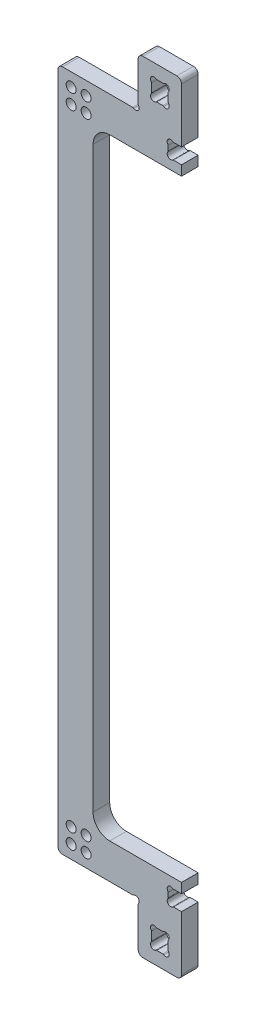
ISO-10303-21;
HEADER;
FILE_DESCRIPTION(('STEP AP214'),'2;1');
FILE_NAME('part.step','',(''),(''),'','','');
FILE_SCHEMA(('AUTOMOTIVE_DESIGN { 1 0 10303 214 1 1 1 1 }'));
ENDSEC;
DATA;
#1=APPLICATION_CONTEXT('core data for automotive mechanical design processes');
#2=APPLICATION_PROTOCOL_DEFINITION('international standard','automotive_design',2000,#1);
#3=PRODUCT_CONTEXT('',#1,'mechanical');
#4=PRODUCT('Part','Part','',(#3));
#5=PRODUCT_RELATED_PRODUCT_CATEGORY('part','',(#4));
#6=PRODUCT_DEFINITION_FORMATION('','',#4);
#7=PRODUCT_DEFINITION_CONTEXT('part definition',#1,'design');
#8=PRODUCT_DEFINITION('design','',#6,#7);
#9=PRODUCT_DEFINITION_SHAPE('','',#8);
#10=(LENGTH_UNIT() NAMED_UNIT(*) SI_UNIT(.MILLI.,.METRE.));
#11=(NAMED_UNIT(*) PLANE_ANGLE_UNIT() SI_UNIT($,.RADIAN.));
#12=(NAMED_UNIT(*) SI_UNIT($,.STERADIAN.) SOLID_ANGLE_UNIT());
#13=UNCERTAINTY_MEASURE_WITH_UNIT(LENGTH_MEASURE(1.E-05),#10,'distance_accuracy_value','');
#14=(GEOMETRIC_REPRESENTATION_CONTEXT(3) GLOBAL_UNCERTAINTY_ASSIGNED_CONTEXT((#13)) GLOBAL_UNIT_ASSIGNED_CONTEXT((#10,
#11,#12)) REPRESENTATION_CONTEXT('',''));
#15=CARTESIAN_POINT('',(0.,0.,0.));
#16=DIRECTION('',(0.,0.,1.));
#17=DIRECTION('',(1.,0.,0.));
#18=AXIS2_PLACEMENT_3D('',#15,#16,#17);
#19=CARTESIAN_POINT('',(2.5,66.0356262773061,25.));
#20=DIRECTION('',(0.,0.,-1.));
#21=DIRECTION('',(-1.,0.,0.));
#22=AXIS2_PLACEMENT_3D('',#19,#20,#21);
#23=PLANE('',#22);
#24=CARTESIAN_POINT('',(-100.8,116.666666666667,25.));
#25=DIRECTION('',(0.,0.,1.));
#26=DIRECTION('',(1.,0.,0.));
#27=AXIS2_PLACEMENT_3D('',#24,#25,#26);
#28=CIRCLE('',#27,7.50000000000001);
#29=CARTESIAN_POINT('',(-93.3,116.666666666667,25.));
#30=VERTEX_POINT('',#29);
#31=EDGE_CURVE('E839',#30,#30,#28,.T.);
#32=ORIENTED_EDGE('',*,*,#31,.F.);
#33=EDGE_LOOP('',(#32));
#34=FACE_BOUND('',#33,.T.);
#35=CARTESIAN_POINT('',(-78.3000000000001,116.666666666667,25.));
#36=DIRECTION('',(0.,0.,1.));
#37=DIRECTION('',(1.,0.,0.));
#38=AXIS2_PLACEMENT_3D('',#35,#36,#37);
#39=CIRCLE('',#38,7.50000000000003);
#40=CARTESIAN_POINT('',(-70.8,116.666666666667,25.));
#41=VERTEX_POINT('',#40);
#42=EDGE_CURVE('E843',#41,#41,#39,.T.);
#43=ORIENTED_EDGE('',*,*,#42,.F.);
#44=EDGE_LOOP('',(#43));
#45=FACE_BOUND('',#44,.T.);
#46=CARTESIAN_POINT('',(-78.3,94.1666666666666,25.));
#47=DIRECTION('',(0.,0.,1.));
#48=DIRECTION('',(1.,0.,0.));
#49=AXIS2_PLACEMENT_3D('',#46,#47,#48);
#50=CIRCLE('',#49,7.50000000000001);
#51=CARTESIAN_POINT('',(-70.8,94.1666666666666,25.));
#52=VERTEX_POINT('',#51);
#53=EDGE_CURVE('E849',#52,#52,#50,.T.);
#54=ORIENTED_EDGE('',*,*,#53,.F.);
#55=EDGE_LOOP('',(#54));
#56=FACE_BOUND('',#55,.T.);
#57=CARTESIAN_POINT('',(-100.8,94.1666666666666,25.));
#58=DIRECTION('',(0.,0.,1.));
#59=DIRECTION('',(1.,0.,0.));
#60=AXIS2_PLACEMENT_3D('',#57,#58,#59);
#61=CIRCLE('',#60,7.50000000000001);
#62=CARTESIAN_POINT('',(-93.3,94.1666666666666,25.));
#63=VERTEX_POINT('',#62);
#64=EDGE_CURVE('E855',#63,#63,#61,.T.);
#65=ORIENTED_EDGE('',*,*,#64,.F.);
#66=EDGE_LOOP('',(#65));
#67=FACE_BOUND('',#66,.T.);
#68=DIRECTION('',(0.,-1.,0.));
#69=VECTOR('',#68,1.);
#70=CARTESIAN_POINT('',(-120.8,74.1666666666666,25.));
#71=LINE('',#70,#69);
#72=CARTESIAN_POINT('',(-120.8,1092.83333333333,25.));
#73=VERTEX_POINT('',#72);
#74=CARTESIAN_POINT('',(-120.8,81.1666666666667,25.));
#75=VERTEX_POINT('',#74);
#76=EDGE_CURVE('E1013',#73,#75,#71,.T.);
#77=ORIENTED_EDGE('',*,*,#76,.T.);
#78=CARTESIAN_POINT('',(-113.8,81.1666666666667,25.));
#79=DIRECTION('',(0.,0.,-1.));
#80=DIRECTION('',(-1.,0.,0.));
#81=AXIS2_PLACEMENT_3D('',#78,#79,#80);
#82=CIRCLE('',#81,7.);
#83=CARTESIAN_POINT('',(-113.8,74.1666666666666,25.));
#84=VERTEX_POINT('',#83);
#85=EDGE_CURVE('E1131',#75,#84,#82,.F.);
#86=ORIENTED_EDGE('',*,*,#85,.T.);
#87=DIRECTION('',(1.,0.,0.));
#88=VECTOR('',#87,1.);
#89=CARTESIAN_POINT('',(-8.13104038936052,74.1666666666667,25.));
#90=LINE('',#89,#88);
#91=CARTESIAN_POINT('',(-8.13104038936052,74.1666666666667,25.));
#92=VERTEX_POINT('',#91);
#93=EDGE_CURVE('E1016',#84,#92,#90,.T.);
#94=ORIENTED_EDGE('',*,*,#93,.T.);
#95=CARTESIAN_POINT('',(-8.13104038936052,76.6666666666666,25.));
#96=DIRECTION('',(0.,0.,1.));
#97=DIRECTION('',(-1.,0.,0.));
#98=AXIS2_PLACEMENT_3D('',#95,#96,#97);
#99=CIRCLE('',#98,2.49999999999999);
#100=CARTESIAN_POINT('',(-6.64262071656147,74.6580335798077,25.));
#101=VERTEX_POINT('',#100);
#102=EDGE_CURVE('E1018',#92,#101,#99,.T.);
#103=ORIENTED_EDGE('',*,*,#102,.T.);
#104=CARTESIAN_POINT('',(-3.60624458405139,70.5604220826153,25.));
#105=DIRECTION('',(0.,0.,-1.));
#106=DIRECTION('',(1.,0.,0.));
#107=AXIS2_PLACEMENT_3D('',#104,#105,#106);
#108=CIRCLE('',#107,5.1);
#109=CARTESIAN_POINT('',(0.49136691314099,67.5240459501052,25.));
#110=VERTEX_POINT('',#109);
#111=EDGE_CURVE('E1020',#101,#110,#108,.T.);
#112=ORIENTED_EDGE('',*,*,#111,.T.);
#113=CARTESIAN_POINT('',(2.5,66.0356262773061,25.));
#114=DIRECTION('',(0.,0.,1.));
#115=DIRECTION('',(-1.,0.,0.));
#116=AXIS2_PLACEMENT_3D('',#113,#114,#115);
#117=CIRCLE('',#116,2.5);
#118=CARTESIAN_POINT('',(0.,66.0356262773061,25.));
#119=VERTEX_POINT('',#118);
#120=EDGE_CURVE('E1022',#110,#119,#117,.T.);
#121=ORIENTED_EDGE('',*,*,#120,.T.);
#122=DIRECTION('',(0.,-1.,0.));
#123=VECTOR('',#122,1.);
#124=CARTESIAN_POINT('',(0.,0.,25.));
#125=LINE('',#124,#123);
#126=CARTESIAN_POINT('',(0.,7.,25.));
#127=VERTEX_POINT('',#126);
#128=EDGE_CURVE('E979',#119,#127,#125,.T.);
#129=ORIENTED_EDGE('',*,*,#128,.T.);
#130=CARTESIAN_POINT('',(7.,7.,25.));
#131=DIRECTION('',(0.,0.,-1.));
#132=DIRECTION('',(-1.,0.,0.));
#133=AXIS2_PLACEMENT_3D('',#130,#131,#132);
#134=CIRCLE('',#133,7.);
#135=CARTESIAN_POINT('',(7.,0.,25.));
#136=VERTEX_POINT('',#135);
#137=EDGE_CURVE('E1128',#127,#136,#134,.F.);
#138=ORIENTED_EDGE('',*,*,#137,.T.);
#139=DIRECTION('',(1.,0.,0.));
#140=VECTOR('',#139,1.);
#141=CARTESIAN_POINT('',(0.,0.,25.));
#142=LINE('',#141,#140);
#143=CARTESIAN_POINT('',(58.2000000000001,0.,25.));
#144=VERTEX_POINT('',#143);
#145=EDGE_CURVE('E982',#136,#144,#142,.T.);
#146=ORIENTED_EDGE('',*,*,#145,.T.);
#147=CARTESIAN_POINT('',(58.2000000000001,7.00000000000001,25.));
#148=DIRECTION('',(0.,0.,-1.));
#149=DIRECTION('',(-1.,0.,0.));
#150=AXIS2_PLACEMENT_3D('',#147,#148,#149);
#151=CIRCLE('',#150,7.);
#152=CARTESIAN_POINT('',(65.2000000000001,7.00000000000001,25.));
#153=VERTEX_POINT('',#152);
#154=EDGE_CURVE('E48',#144,#153,#151,.F.);
#155=ORIENTED_EDGE('',*,*,#154,.T.);
#156=DIRECTION('',(0.,1.,0.));
#157=VECTOR('',#156,1.);
#158=CARTESIAN_POINT('',(65.2000000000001,89.0666666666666,25.));
#159=LINE('',#158,#157);
#160=CARTESIAN_POINT('',(65.2000000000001,89.0666666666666,25.));
#161=VERTEX_POINT('',#160);
#162=EDGE_CURVE('E985',#153,#161,#159,.T.);
#163=ORIENTED_EDGE('',*,*,#162,.T.);
#164=DIRECTION('',(-1.,0.,0.));
#165=VECTOR('',#164,1.);
#166=CARTESIAN_POINT('',(65.2000000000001,89.0666666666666,25.));
#167=LINE('',#166,#165);
#168=CARTESIAN_POINT('',(53.2310403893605,89.0666666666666,25.));
#169=VERTEX_POINT('',#168);
#170=EDGE_CURVE('E987',#161,#169,#167,.T.);
#171=ORIENTED_EDGE('',*,*,#170,.T.);
#172=CARTESIAN_POINT('',(53.2310403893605,86.5666666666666,25.));
#173=DIRECTION('',(0.,0.,1.));
#174=DIRECTION('',(-1.,0.,0.));
#175=AXIS2_PLACEMENT_3D('',#172,#173,#174);
#176=CIRCLE('',#175,2.50000000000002);
#177=CARTESIAN_POINT('',(51.7426207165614,88.5752997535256,25.));
#178=VERTEX_POINT('',#177);
#179=EDGE_CURVE('E989',#169,#178,#176,.T.);
#180=ORIENTED_EDGE('',*,*,#179,.T.);
#181=CARTESIAN_POINT('',(48.7062445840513,92.6729112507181,25.));
#182=DIRECTION('',(0.,0.,-1.));
#183=DIRECTION('',(1.,0.,0.));
#184=AXIS2_PLACEMENT_3D('',#181,#182,#183);
#185=CIRCLE('',#184,5.1);
#186=CARTESIAN_POINT('',(44.608633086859,95.7092873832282,25.));
#187=VERTEX_POINT('',#186);
#188=EDGE_CURVE('E991',#178,#187,#185,.T.);
#189=ORIENTED_EDGE('',*,*,#188,.T.);
#190=CARTESIAN_POINT('',(42.6000000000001,97.1977070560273,25.));
#191=DIRECTION('',(0.,0.,1.));
#192=DIRECTION('',(1.,0.,0.));
#193=AXIS2_PLACEMENT_3D('',#190,#191,#192);
#194=CIRCLE('',#193,2.49999999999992);
#195=CARTESIAN_POINT('',(45.1,97.1977070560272,25.));
#196=VERTEX_POINT('',#195);
#197=EDGE_CURVE('E993',#187,#196,#194,.T.);
#198=ORIENTED_EDGE('',*,*,#197,.T.);
#199=DIRECTION('',(0.,1.,0.));
#200=VECTOR('',#199,1.);
#201=CARTESIAN_POINT('',(45.1,97.1977070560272,25.));
#202=LINE('',#201,#200);
#203=CARTESIAN_POINT('',(45.1000000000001,104.135626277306,25.));
#204=VERTEX_POINT('',#203);
#205=EDGE_CURVE('E995',#196,#204,#202,.T.);
#206=ORIENTED_EDGE('',*,*,#205,.T.);
#207=CARTESIAN_POINT('',(42.6000000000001,104.135626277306,25.));
#208=DIRECTION('',(0.,0.,1.));
#209=DIRECTION('',(-1.,0.,0.));
#210=AXIS2_PLACEMENT_3D('',#207,#208,#209);
#211=CIRCLE('',#210,2.5);
#212=CARTESIAN_POINT('',(44.6086330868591,105.624045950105,25.));
#213=VERTEX_POINT('',#212);
#214=EDGE_CURVE('E997',#204,#213,#211,.T.);
#215=ORIENTED_EDGE('',*,*,#214,.T.);
#216=CARTESIAN_POINT('',(48.7062445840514,108.660422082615,25.));
#217=DIRECTION('',(0.,0.,-1.));
#218=DIRECTION('',(-1.,0.,0.));
#219=AXIS2_PLACEMENT_3D('',#216,#217,#218);
#220=CIRCLE('',#219,5.1);
#221=CARTESIAN_POINT('',(51.7426207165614,112.758033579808,25.));
#222=VERTEX_POINT('',#221);
#223=EDGE_CURVE('E999',#213,#222,#220,.T.);
#224=ORIENTED_EDGE('',*,*,#223,.T.);
#225=CARTESIAN_POINT('',(53.2310403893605,114.766666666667,25.));
#226=DIRECTION('',(0.,0.,1.));
#227=DIRECTION('',(1.,0.,0.));
#228=AXIS2_PLACEMENT_3D('',#225,#226,#227);
#229=CIRCLE('',#228,2.49999999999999);
#230=CARTESIAN_POINT('',(53.2310403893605,112.266666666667,25.));
#231=VERTEX_POINT('',#230);
#232=EDGE_CURVE('E1001',#222,#231,#229,.T.);
#233=ORIENTED_EDGE('',*,*,#232,.T.);
#234=DIRECTION('',(1.,0.,0.));
#235=VECTOR('',#234,1.);
#236=CARTESIAN_POINT('',(65.2000000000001,112.266666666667,25.));
#237=LINE('',#236,#235);
#238=CARTESIAN_POINT('',(65.2000000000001,112.266666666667,25.));
#239=VERTEX_POINT('',#238);
#240=EDGE_CURVE('E1003',#231,#239,#237,.T.);
#241=ORIENTED_EDGE('',*,*,#240,.T.);
#242=DIRECTION('',(0.,1.,0.));
#243=VECTOR('',#242,1.);
#244=CARTESIAN_POINT('',(65.2000000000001,127.166666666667,25.));
#245=LINE('',#244,#243);
#246=CARTESIAN_POINT('',(65.2000000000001,127.166666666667,25.));
#247=VERTEX_POINT('',#246);
#248=EDGE_CURVE('E1005',#239,#247,#245,.T.);
#249=ORIENTED_EDGE('',*,*,#248,.T.);
#250=DIRECTION('',(-1.,0.,0.));
#251=VECTOR('',#250,1.);
#252=CARTESIAN_POINT('',(-42.8,127.166666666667,25.));
#253=LINE('',#252,#251);
#254=CARTESIAN_POINT('',(-42.8,127.166666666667,25.));
#255=VERTEX_POINT('',#254);
#256=EDGE_CURVE('E1007',#247,#255,#253,.T.);
#257=ORIENTED_EDGE('',*,*,#256,.T.);
#258=CARTESIAN_POINT('',(-42.8,152.166666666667,25.));
#259=DIRECTION('',(0.,0.,-1.));
#260=DIRECTION('',(1.,0.,0.));
#261=AXIS2_PLACEMENT_3D('',#258,#259,#260);
#262=CIRCLE('',#261,25.);
#263=CARTESIAN_POINT('',(-67.8,152.166666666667,25.));
#264=VERTEX_POINT('',#263);
#265=EDGE_CURVE('E1009',#255,#264,#262,.T.);
#266=ORIENTED_EDGE('',*,*,#265,.T.);
#267=DIRECTION('',(0.,1.,0.));
#268=VECTOR('',#267,1.);
#269=CARTESIAN_POINT('',(-67.8,152.166666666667,25.));
#270=LINE('',#269,#268);
#271=CARTESIAN_POINT('',(-67.8,1021.83333333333,25.));
#272=VERTEX_POINT('',#271);
#273=EDGE_CURVE('E1011',#264,#272,#270,.T.);
#274=ORIENTED_EDGE('',*,*,#273,.T.);
#275=CARTESIAN_POINT('',(-42.8,1021.83333333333,25.));
#276=DIRECTION('',(0.,0.,1.));
#277=DIRECTION('',(1.,0.,0.));
#278=AXIS2_PLACEMENT_3D('',#275,#276,#277);
#279=CIRCLE('',#278,25.);
#280=CARTESIAN_POINT('',(-42.8,1046.83333333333,25.));
#281=VERTEX_POINT('',#280);
#282=EDGE_CURVE('E703',#281,#272,#279,.T.);
#283=ORIENTED_EDGE('',*,*,#282,.F.);
#284=DIRECTION('',(-1.,0.,0.));
#285=VECTOR('',#284,1.);
#286=CARTESIAN_POINT('',(-42.8,1046.83333333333,25.));
#287=LINE('',#286,#285);
#288=CARTESIAN_POINT('',(65.2000000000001,1046.83333333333,25.));
#289=VERTEX_POINT('',#288);
#290=EDGE_CURVE('E700',#289,#281,#287,.T.);
#291=ORIENTED_EDGE('',*,*,#290,.F.);
#292=DIRECTION('',(0.,-1.,0.));
#293=VECTOR('',#292,1.);
#294=CARTESIAN_POINT('',(65.2000000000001,1046.83333333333,25.));
#295=LINE('',#294,#293);
#296=CARTESIAN_POINT('',(65.2000000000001,1061.73333333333,25.));
#297=VERTEX_POINT('',#296);
#298=EDGE_CURVE('E697',#297,#289,#295,.T.);
#299=ORIENTED_EDGE('',*,*,#298,.F.);
#300=DIRECTION('',(1.,0.,0.));
#301=VECTOR('',#300,1.);
#302=CARTESIAN_POINT('',(65.2000000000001,1061.73333333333,25.));
#303=LINE('',#302,#301);
#304=CARTESIAN_POINT('',(53.2310403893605,1061.73333333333,25.));
#305=VERTEX_POINT('',#304);
#306=EDGE_CURVE('E694',#305,#297,#303,.T.);
#307=ORIENTED_EDGE('',*,*,#306,.F.);
#308=CARTESIAN_POINT('',(53.2310403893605,1059.23333333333,25.));
#309=DIRECTION('',(0.,0.,-1.));
#310=DIRECTION('',(1.,0.,0.));
#311=AXIS2_PLACEMENT_3D('',#308,#309,#310);
#312=CIRCLE('',#311,2.49999999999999);
#313=CARTESIAN_POINT('',(51.7426207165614,1061.24196642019,25.));
#314=VERTEX_POINT('',#313);
#315=EDGE_CURVE('E691',#314,#305,#312,.T.);
#316=ORIENTED_EDGE('',*,*,#315,.F.);
#317=CARTESIAN_POINT('',(48.7062445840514,1065.33957791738,25.));
#318=DIRECTION('',(0.,0.,1.));
#319=DIRECTION('',(-1.,0.,0.));
#320=AXIS2_PLACEMENT_3D('',#317,#318,#319);
#321=CIRCLE('',#320,5.1);
#322=CARTESIAN_POINT('',(44.6086330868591,1068.37595404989,25.));
#323=VERTEX_POINT('',#322);
#324=EDGE_CURVE('E688',#323,#314,#321,.T.);
#325=ORIENTED_EDGE('',*,*,#324,.F.);
#326=CARTESIAN_POINT('',(42.6000000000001,1069.86437372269,25.));
#327=DIRECTION('',(0.,0.,-1.));
#328=DIRECTION('',(-1.,0.,0.));
#329=AXIS2_PLACEMENT_3D('',#326,#327,#328);
#330=CIRCLE('',#329,2.5);
#331=CARTESIAN_POINT('',(45.1000000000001,1069.86437372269,25.));
#332=VERTEX_POINT('',#331);
#333=EDGE_CURVE('E685',#332,#323,#330,.T.);
#334=ORIENTED_EDGE('',*,*,#333,.F.);
#335=DIRECTION('',(0.,-1.,0.));
#336=VECTOR('',#335,1.);
#337=CARTESIAN_POINT('',(45.1,1076.80229294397,25.));
#338=LINE('',#337,#336);
#339=CARTESIAN_POINT('',(45.1,1076.80229294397,25.));
#340=VERTEX_POINT('',#339);
#341=EDGE_CURVE('E682',#340,#332,#338,.T.);
#342=ORIENTED_EDGE('',*,*,#341,.F.);
#343=CARTESIAN_POINT('',(42.6000000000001,1076.80229294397,25.));
#344=DIRECTION('',(0.,0.,-1.));
#345=DIRECTION('',(1.,0.,0.));
#346=AXIS2_PLACEMENT_3D('',#343,#344,#345);
#347=CIRCLE('',#346,2.49999999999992);
#348=CARTESIAN_POINT('',(44.608633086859,1078.29071261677,25.));
#349=VERTEX_POINT('',#348);
#350=EDGE_CURVE('E679',#349,#340,#347,.T.);
#351=ORIENTED_EDGE('',*,*,#350,.F.);
#352=CARTESIAN_POINT('',(48.7062445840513,1081.32708874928,25.));
#353=DIRECTION('',(0.,0.,1.));
#354=DIRECTION('',(1.,0.,0.));
#355=AXIS2_PLACEMENT_3D('',#352,#353,#354);
#356=CIRCLE('',#355,5.1);
#357=CARTESIAN_POINT('',(51.7426207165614,1085.42470024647,25.));
#358=VERTEX_POINT('',#357);
#359=EDGE_CURVE('E676',#358,#349,#356,.T.);
#360=ORIENTED_EDGE('',*,*,#359,.F.);
#361=CARTESIAN_POINT('',(53.2310403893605,1087.43333333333,25.));
#362=DIRECTION('',(0.,0.,-1.));
#363=DIRECTION('',(-1.,0.,0.));
#364=AXIS2_PLACEMENT_3D('',#361,#362,#363);
#365=CIRCLE('',#364,2.50000000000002);
#366=CARTESIAN_POINT('',(53.2310403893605,1084.93333333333,25.));
#367=VERTEX_POINT('',#366);
#368=EDGE_CURVE('E673',#367,#358,#365,.T.);
#369=ORIENTED_EDGE('',*,*,#368,.F.);
#370=DIRECTION('',(-1.,0.,0.));
#371=VECTOR('',#370,1.);
#372=CARTESIAN_POINT('',(65.2000000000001,1084.93333333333,25.));
#373=LINE('',#372,#371);
#374=CARTESIAN_POINT('',(65.2000000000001,1084.93333333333,25.));
#375=VERTEX_POINT('',#374);
#376=EDGE_CURVE('E670',#375,#367,#373,.T.);
#377=ORIENTED_EDGE('',*,*,#376,.F.);
#378=DIRECTION('',(0.,-1.,0.));
#379=VECTOR('',#378,1.);
#380=CARTESIAN_POINT('',(65.2000000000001,1084.93333333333,25.));
#381=LINE('',#380,#379);
#382=CARTESIAN_POINT('',(65.2000000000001,1167.,25.));
#383=VERTEX_POINT('',#382);
#384=EDGE_CURVE('E667',#383,#375,#381,.T.);
#385=ORIENTED_EDGE('',*,*,#384,.F.);
#386=CARTESIAN_POINT('',(58.2000000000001,1167.,25.));
#387=DIRECTION('',(0.,0.,1.));
#388=DIRECTION('',(-1.,0.,0.));
#389=AXIS2_PLACEMENT_3D('',#386,#387,#388);
#390=CIRCLE('',#389,7.);
#391=CARTESIAN_POINT('',(58.2000000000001,1174.,25.));
#392=VERTEX_POINT('',#391);
#393=EDGE_CURVE('E825',#392,#383,#390,.F.);
#394=ORIENTED_EDGE('',*,*,#393,.F.);
#395=DIRECTION('',(1.,0.,0.));
#396=VECTOR('',#395,1.);
#397=CARTESIAN_POINT('',(0.,1174.,25.));
#398=LINE('',#397,#396);
#399=CARTESIAN_POINT('',(7.,1174.,25.));
#400=VERTEX_POINT('',#399);
#401=EDGE_CURVE('E663',#400,#392,#398,.T.);
#402=ORIENTED_EDGE('',*,*,#401,.F.);
#403=CARTESIAN_POINT('',(7.,1167.,25.));
#404=DIRECTION('',(0.,0.,1.));
#405=DIRECTION('',(-1.,0.,0.));
#406=AXIS2_PLACEMENT_3D('',#403,#404,#405);
#407=CIRCLE('',#406,7.);
#408=CARTESIAN_POINT('',(0.,1167.,25.));
#409=VERTEX_POINT('',#408);
#410=EDGE_CURVE('E822',#409,#400,#407,.F.);
#411=ORIENTED_EDGE('',*,*,#410,.F.);
#412=DIRECTION('',(0.,1.,0.));
#413=VECTOR('',#412,1.);
#414=CARTESIAN_POINT('',(0.,1174.,25.));
#415=LINE('',#414,#413);
#416=CARTESIAN_POINT('',(0.,1107.96437372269,25.));
#417=VERTEX_POINT('',#416);
#418=EDGE_CURVE('E660',#417,#409,#415,.T.);
#419=ORIENTED_EDGE('',*,*,#418,.F.);
#420=CARTESIAN_POINT('',(2.5,1107.96437372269,25.));
#421=DIRECTION('',(0.,0.,-1.));
#422=DIRECTION('',(-1.,0.,0.));
#423=AXIS2_PLACEMENT_3D('',#420,#421,#422);
#424=CIRCLE('',#423,2.5);
#425=CARTESIAN_POINT('',(0.49136691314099,1106.47595404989,25.));
#426=VERTEX_POINT('',#425);
#427=EDGE_CURVE('E715',#426,#417,#424,.T.);
#428=ORIENTED_EDGE('',*,*,#427,.F.);
#429=CARTESIAN_POINT('',(-3.60624458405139,1103.43957791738,25.));
#430=DIRECTION('',(0.,0.,1.));
#431=DIRECTION('',(1.,0.,0.));
#432=AXIS2_PLACEMENT_3D('',#429,#430,#431);
#433=CIRCLE('',#432,5.1);
#434=CARTESIAN_POINT('',(-6.64262071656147,1099.34196642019,25.));
#435=VERTEX_POINT('',#434);
#436=EDGE_CURVE('E712',#435,#426,#433,.T.);
#437=ORIENTED_EDGE('',*,*,#436,.F.);
#438=CARTESIAN_POINT('',(-8.13104038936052,1097.33333333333,25.));
#439=DIRECTION('',(0.,0.,-1.));
#440=DIRECTION('',(-1.,0.,0.));
#441=AXIS2_PLACEMENT_3D('',#438,#439,#440);
#442=CIRCLE('',#441,2.49999999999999);
#443=CARTESIAN_POINT('',(-8.13104038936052,1099.83333333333,25.));
#444=VERTEX_POINT('',#443);
#445=EDGE_CURVE('E709',#444,#435,#442,.T.);
#446=ORIENTED_EDGE('',*,*,#445,.F.);
#447=DIRECTION('',(1.,0.,0.));
#448=VECTOR('',#447,1.);
#449=CARTESIAN_POINT('',(-8.13104038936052,1099.83333333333,25.));
#450=LINE('',#449,#448);
#451=CARTESIAN_POINT('',(-113.8,1099.83333333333,25.));
#452=VERTEX_POINT('',#451);
#453=EDGE_CURVE('E706',#452,#444,#450,.T.);
#454=ORIENTED_EDGE('',*,*,#453,.F.);
#455=CARTESIAN_POINT('',(-113.8,1092.83333333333,25.));
#456=DIRECTION('',(0.,0.,1.));
#457=DIRECTION('',(-1.,0.,0.));
#458=AXIS2_PLACEMENT_3D('',#455,#456,#457);
#459=CIRCLE('',#458,7.);
#460=EDGE_CURVE('E828',#73,#452,#459,.F.);
#461=ORIENTED_EDGE('',*,*,#460,.F.);
#462=EDGE_LOOP('',(#77,#86,#94,#103,#112,#121,#129,#138,#146,#155,#163,#171,#180,#189,#198,#206,
#215,#224,#233,#241,#249,#257,#266,#274,#283,#291,#299,#307,#316,#325,#334,#342,#351,#360,#369,
#377,#385,#394,#402,#411,#419,#428,#437,#446,#454,#461));
#463=FACE_BOUND('',#462,.T.);
#464=CARTESIAN_POINT('',(17.5000000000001,28.1310403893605,25.));
#465=DIRECTION('',(0.,0.,-1.));
#466=DIRECTION('',(1.,0.,0.));
#467=AXIS2_PLACEMENT_3D('',#464,#465,#466);
#468=CIRCLE('',#467,2.5);
#469=CARTESIAN_POINT('',(20.0000000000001,28.1310403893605,25.));
#470=VERTEX_POINT('',#469);
#471=CARTESIAN_POINT('',(19.5086330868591,26.6426207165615,25.));
#472=VERTEX_POINT('',#471);
#473=EDGE_CURVE('E864',#470,#472,#468,.T.);
#474=ORIENTED_EDGE('',*,*,#473,.F.);
#475=DIRECTION('',(0.,-1.,0.));
#476=VECTOR('',#475,1.);
#477=CARTESIAN_POINT('',(20.0000000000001,41.0356262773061,25.));
#478=LINE('',#477,#476);
#479=CARTESIAN_POINT('',(20.0000000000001,41.0356262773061,25.));
#480=VERTEX_POINT('',#479);
#481=EDGE_CURVE('E896',#480,#470,#478,.T.);
#482=ORIENTED_EDGE('',*,*,#481,.F.);
#483=CARTESIAN_POINT('',(17.5000000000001,41.0356262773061,25.));
#484=DIRECTION('',(0.,0.,-1.));
#485=DIRECTION('',(-1.,0.,0.));
#486=AXIS2_PLACEMENT_3D('',#483,#484,#485);
#487=CIRCLE('',#486,2.5);
#488=CARTESIAN_POINT('',(19.5086330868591,42.5240459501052,25.));
#489=VERTEX_POINT('',#488);
#490=EDGE_CURVE('E893',#489,#480,#487,.T.);
#491=ORIENTED_EDGE('',*,*,#490,.F.);
#492=CARTESIAN_POINT('',(23.6062445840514,45.5604220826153,25.));
#493=DIRECTION('',(0.,0.,1.));
#494=DIRECTION('',(-1.,0.,0.));
#495=AXIS2_PLACEMENT_3D('',#492,#493,#494);
#496=CIRCLE('',#495,5.1);
#497=CARTESIAN_POINT('',(26.6426207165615,49.6580335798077,25.));
#498=VERTEX_POINT('',#497);
#499=EDGE_CURVE('E891',#498,#489,#496,.T.);
#500=ORIENTED_EDGE('',*,*,#499,.F.);
#501=CARTESIAN_POINT('',(28.1310403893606,51.6666666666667,25.));
#502=DIRECTION('',(0.,0.,-1.));
#503=DIRECTION('',(1.,0.,0.));
#504=AXIS2_PLACEMENT_3D('',#501,#502,#503);
#505=CIRCLE('',#504,2.5);
#506=CARTESIAN_POINT('',(28.1310403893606,49.1666666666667,25.));
#507=VERTEX_POINT('',#506);
#508=EDGE_CURVE('E889',#507,#498,#505,.T.);
#509=ORIENTED_EDGE('',*,*,#508,.F.);
#510=DIRECTION('',(-1.,0.,0.));
#511=VECTOR('',#510,1.);
#512=CARTESIAN_POINT('',(28.1310403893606,49.1666666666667,25.));
#513=LINE('',#512,#511);
#514=CARTESIAN_POINT('',(37.0689596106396,49.1666666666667,25.));
#515=VERTEX_POINT('',#514);
#516=EDGE_CURVE('E887',#515,#507,#513,.T.);
#517=ORIENTED_EDGE('',*,*,#516,.F.);
#518=CARTESIAN_POINT('',(37.0689596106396,51.6666666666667,25.));
#519=DIRECTION('',(0.,0.,-1.));
#520=DIRECTION('',(-1.,0.,0.));
#521=AXIS2_PLACEMENT_3D('',#518,#519,#520);
#522=CIRCLE('',#521,2.5);
#523=CARTESIAN_POINT('',(38.5573792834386,49.6580335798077,25.));
#524=VERTEX_POINT('',#523);
#525=EDGE_CURVE('E885',#524,#515,#522,.T.);
#526=ORIENTED_EDGE('',*,*,#525,.F.);
#527=CARTESIAN_POINT('',(41.5937554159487,45.5604220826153,25.));
#528=DIRECTION('',(0.,0.,1.));
#529=DIRECTION('',(1.,0.,0.));
#530=AXIS2_PLACEMENT_3D('',#527,#528,#529);
#531=CIRCLE('',#530,5.1);
#532=CARTESIAN_POINT('',(45.6913669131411,42.5240459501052,25.));
#533=VERTEX_POINT('',#532);
#534=EDGE_CURVE('E883',#533,#524,#531,.T.);
#535=ORIENTED_EDGE('',*,*,#534,.F.);
#536=CARTESIAN_POINT('',(47.7000000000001,41.0356262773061,25.));
#537=DIRECTION('',(0.,0.,-1.));
#538=DIRECTION('',(1.,0.,0.));
#539=AXIS2_PLACEMENT_3D('',#536,#537,#538);
#540=CIRCLE('',#539,2.5);
#541=CARTESIAN_POINT('',(45.2000000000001,41.0356262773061,25.));
#542=VERTEX_POINT('',#541);
#543=EDGE_CURVE('E881',#542,#533,#540,.T.);
#544=ORIENTED_EDGE('',*,*,#543,.F.);
#545=DIRECTION('',(0.,1.,0.));
#546=VECTOR('',#545,1.);
#547=CARTESIAN_POINT('',(45.2000000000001,41.0356262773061,25.));
#548=LINE('',#547,#546);
#549=CARTESIAN_POINT('',(45.2000000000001,28.1310403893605,25.));
#550=VERTEX_POINT('',#549);
#551=EDGE_CURVE('E879',#550,#542,#548,.T.);
#552=ORIENTED_EDGE('',*,*,#551,.F.);
#553=CARTESIAN_POINT('',(47.7000000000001,28.1310403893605,25.));
#554=DIRECTION('',(0.,0.,-1.));
#555=DIRECTION('',(-1.,0.,0.));
#556=AXIS2_PLACEMENT_3D('',#553,#554,#555);
#557=CIRCLE('',#556,2.5);
#558=CARTESIAN_POINT('',(45.6913669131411,26.6426207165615,25.));
#559=VERTEX_POINT('',#558);
#560=EDGE_CURVE('E877',#559,#550,#557,.T.);
#561=ORIENTED_EDGE('',*,*,#560,.F.);
#562=CARTESIAN_POINT('',(41.5937554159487,23.6062445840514,25.));
#563=DIRECTION('',(0.,0.,1.));
#564=DIRECTION('',(-1.,0.,0.));
#565=AXIS2_PLACEMENT_3D('',#562,#563,#564);
#566=CIRCLE('',#565,5.1);
#567=CARTESIAN_POINT('',(38.5573792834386,19.508633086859,25.));
#568=VERTEX_POINT('',#567);
#569=EDGE_CURVE('E875',#568,#559,#566,.T.);
#570=ORIENTED_EDGE('',*,*,#569,.F.);
#571=CARTESIAN_POINT('',(37.0689596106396,17.5,25.));
#572=DIRECTION('',(0.,0.,-1.));
#573=DIRECTION('',(1.,0.,0.));
#574=AXIS2_PLACEMENT_3D('',#571,#572,#573);
#575=CIRCLE('',#574,2.5);
#576=CARTESIAN_POINT('',(37.0689596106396,20.,25.));
#577=VERTEX_POINT('',#576);
#578=EDGE_CURVE('E873',#577,#568,#575,.T.);
#579=ORIENTED_EDGE('',*,*,#578,.F.);
#580=DIRECTION('',(1.,0.,0.));
#581=VECTOR('',#580,1.);
#582=CARTESIAN_POINT('',(28.1310403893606,20.,25.));
#583=LINE('',#582,#581);
#584=CARTESIAN_POINT('',(28.1310403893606,20.,25.));
#585=VERTEX_POINT('',#584);
#586=EDGE_CURVE('E871',#585,#577,#583,.T.);
#587=ORIENTED_EDGE('',*,*,#586,.F.);
#588=CARTESIAN_POINT('',(28.1310403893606,17.5,25.));
#589=DIRECTION('',(0.,0.,-1.));
#590=DIRECTION('',(-1.,0.,0.));
#591=AXIS2_PLACEMENT_3D('',#588,#589,#590);
#592=CIRCLE('',#591,2.5);
#593=CARTESIAN_POINT('',(26.6426207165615,19.508633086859,25.));
#594=VERTEX_POINT('',#593);
#595=EDGE_CURVE('E869',#594,#585,#592,.T.);
#596=ORIENTED_EDGE('',*,*,#595,.F.);
#597=CARTESIAN_POINT('',(23.6062445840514,23.6062445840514,25.));
#598=DIRECTION('',(0.,0.,1.));
#599=DIRECTION('',(1.,0.,0.));
#600=AXIS2_PLACEMENT_3D('',#597,#598,#599);
#601=CIRCLE('',#600,5.1);
#602=EDGE_CURVE('E866',#472,#594,#601,.T.);
#603=ORIENTED_EDGE('',*,*,#602,.F.);
#604=EDGE_LOOP('',(#474,#482,#491,#500,#509,#517,#526,#535,#544,#552,#561,#570,#579,#587,#596,#603));
#605=FACE_BOUND('',#604,.T.);
#606=CARTESIAN_POINT('',(-100.8,1057.33333333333,25.));
#607=DIRECTION('',(0.,0.,-1.));
#608=DIRECTION('',(1.,0.,0.));
#609=AXIS2_PLACEMENT_3D('',#606,#607,#608);
#610=CIRCLE('',#609,7.50000000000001);
#611=CARTESIAN_POINT('',(-93.3,1057.33333333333,25.));
#612=VERTEX_POINT('',#611);
#613=EDGE_CURVE('E1540',#612,#612,#610,.T.);
#614=ORIENTED_EDGE('',*,*,#613,.T.);
#615=EDGE_LOOP('',(#614));
#616=FACE_BOUND('',#615,.T.);
#617=CARTESIAN_POINT('',(-78.3000000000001,1057.33333333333,25.));
#618=DIRECTION('',(0.,0.,-1.));
#619=DIRECTION('',(1.,0.,0.));
#620=AXIS2_PLACEMENT_3D('',#617,#618,#619);
#621=CIRCLE('',#620,7.50000000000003);
#622=CARTESIAN_POINT('',(-70.8,1057.33333333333,25.));
#623=VERTEX_POINT('',#622);
#624=EDGE_CURVE('E1544',#623,#623,#621,.T.);
#625=ORIENTED_EDGE('',*,*,#624,.T.);
#626=EDGE_LOOP('',(#625));
#627=FACE_BOUND('',#626,.T.);
#628=CARTESIAN_POINT('',(-78.3,1079.83333333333,25.));
#629=DIRECTION('',(0.,0.,-1.));
#630=DIRECTION('',(1.,0.,0.));
#631=AXIS2_PLACEMENT_3D('',#628,#629,#630);
#632=CIRCLE('',#631,7.50000000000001);
#633=CARTESIAN_POINT('',(-70.8,1079.83333333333,25.));
#634=VERTEX_POINT('',#633);
#635=EDGE_CURVE('E1548',#634,#634,#632,.T.);
#636=ORIENTED_EDGE('',*,*,#635,.T.);
#637=EDGE_LOOP('',(#636));
#638=FACE_BOUND('',#637,.T.);
#639=CARTESIAN_POINT('',(-100.8,1079.83333333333,25.));
#640=DIRECTION('',(0.,0.,-1.));
#641=DIRECTION('',(1.,0.,0.));
#642=AXIS2_PLACEMENT_3D('',#639,#640,#641);
#643=CIRCLE('',#642,7.50000000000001);
#644=CARTESIAN_POINT('',(-93.3,1079.83333333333,25.));
#645=VERTEX_POINT('',#644);
#646=EDGE_CURVE('E549',#645,#645,#643,.T.);
#647=ORIENTED_EDGE('',*,*,#646,.T.);
#648=EDGE_LOOP('',(#647));
#649=FACE_BOUND('',#648,.T.);
#650=CARTESIAN_POINT('',(17.5000000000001,1145.86895961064,25.));
#651=DIRECTION('',(0.,0.,1.));
#652=DIRECTION('',(1.,0.,0.));
#653=AXIS2_PLACEMENT_3D('',#650,#651,#652);
#654=CIRCLE('',#653,2.5);
#655=CARTESIAN_POINT('',(20.0000000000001,1145.86895961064,25.));
#656=VERTEX_POINT('',#655);
#657=CARTESIAN_POINT('',(19.5086330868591,1147.35737928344,25.));
#658=VERTEX_POINT('',#657);
#659=EDGE_CURVE('E522',#656,#658,#654,.T.);
#660=ORIENTED_EDGE('',*,*,#659,.T.);
#661=CARTESIAN_POINT('',(23.6062445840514,1150.39375541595,25.));
#662=DIRECTION('',(0.,0.,-1.));
#663=DIRECTION('',(1.,0.,0.));
#664=AXIS2_PLACEMENT_3D('',#661,#662,#663);
#665=CIRCLE('',#664,5.1);
#666=CARTESIAN_POINT('',(26.6426207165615,1154.49136691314,25.));
#667=VERTEX_POINT('',#666);
#668=EDGE_CURVE('E532',#658,#667,#665,.T.);
#669=ORIENTED_EDGE('',*,*,#668,.T.);
#670=CARTESIAN_POINT('',(28.1310403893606,1156.5,25.));
#671=DIRECTION('',(0.,0.,1.));
#672=DIRECTION('',(-1.,0.,0.));
#673=AXIS2_PLACEMENT_3D('',#670,#671,#672);
#674=CIRCLE('',#673,2.5);
#675=CARTESIAN_POINT('',(28.1310403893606,1154.,25.));
#676=VERTEX_POINT('',#675);
#677=EDGE_CURVE('E537',#667,#676,#674,.T.);
#678=ORIENTED_EDGE('',*,*,#677,.T.);
#679=DIRECTION('',(1.,0.,0.));
#680=VECTOR('',#679,1.);
#681=CARTESIAN_POINT('',(28.1310403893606,1154.,25.));
#682=LINE('',#681,#680);
#683=CARTESIAN_POINT('',(37.0689596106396,1154.,25.));
#684=VERTEX_POINT('',#683);
#685=EDGE_CURVE('E553',#676,#684,#682,.T.);
#686=ORIENTED_EDGE('',*,*,#685,.T.);
#687=CARTESIAN_POINT('',(37.0689596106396,1156.5,25.));
#688=DIRECTION('',(0.,0.,1.));
#689=DIRECTION('',(1.,0.,0.));
#690=AXIS2_PLACEMENT_3D('',#687,#688,#689);
#691=CIRCLE('',#690,2.5);
#692=CARTESIAN_POINT('',(38.5573792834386,1154.49136691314,25.));
#693=VERTEX_POINT('',#692);
#694=EDGE_CURVE('E556',#684,#693,#691,.T.);
#695=ORIENTED_EDGE('',*,*,#694,.T.);
#696=CARTESIAN_POINT('',(41.5937554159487,1150.39375541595,25.));
#697=DIRECTION('',(0.,0.,-1.));
#698=DIRECTION('',(-1.,0.,0.));
#699=AXIS2_PLACEMENT_3D('',#696,#697,#698);
#700=CIRCLE('',#699,5.1);
#701=CARTESIAN_POINT('',(45.6913669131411,1147.35737928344,25.));
#702=VERTEX_POINT('',#701);
#703=EDGE_CURVE('E559',#693,#702,#700,.T.);
#704=ORIENTED_EDGE('',*,*,#703,.T.);
#705=CARTESIAN_POINT('',(47.7000000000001,1145.86895961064,25.));
#706=DIRECTION('',(0.,0.,1.));
#707=DIRECTION('',(-1.,0.,0.));
#708=AXIS2_PLACEMENT_3D('',#705,#706,#707);
#709=CIRCLE('',#708,2.5);
#710=CARTESIAN_POINT('',(45.2000000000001,1145.86895961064,25.));
#711=VERTEX_POINT('',#710);
#712=EDGE_CURVE('E562',#702,#711,#709,.T.);
#713=ORIENTED_EDGE('',*,*,#712,.T.);
#714=DIRECTION('',(0.,-1.,0.));
#715=VECTOR('',#714,1.);
#716=CARTESIAN_POINT('',(45.2000000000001,1132.96437372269,25.));
#717=LINE('',#716,#715);
#718=CARTESIAN_POINT('',(45.2000000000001,1132.96437372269,25.));
#719=VERTEX_POINT('',#718);
#720=EDGE_CURVE('E565',#711,#719,#717,.T.);
#721=ORIENTED_EDGE('',*,*,#720,.T.);
#722=CARTESIAN_POINT('',(47.7000000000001,1132.96437372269,25.));
#723=DIRECTION('',(0.,0.,1.));
#724=DIRECTION('',(1.,0.,0.));
#725=AXIS2_PLACEMENT_3D('',#722,#723,#724);
#726=CIRCLE('',#725,2.5);
#727=CARTESIAN_POINT('',(45.6913669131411,1131.47595404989,25.));
#728=VERTEX_POINT('',#727);
#729=EDGE_CURVE('E568',#719,#728,#726,.T.);
#730=ORIENTED_EDGE('',*,*,#729,.T.);
#731=CARTESIAN_POINT('',(41.5937554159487,1128.43957791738,25.));
#732=DIRECTION('',(0.,0.,-1.));
#733=DIRECTION('',(1.,0.,0.));
#734=AXIS2_PLACEMENT_3D('',#731,#732,#733);
#735=CIRCLE('',#734,5.1);
#736=CARTESIAN_POINT('',(38.5573792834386,1124.34196642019,25.));
#737=VERTEX_POINT('',#736);
#738=EDGE_CURVE('E571',#728,#737,#735,.T.);
#739=ORIENTED_EDGE('',*,*,#738,.T.);
#740=CARTESIAN_POINT('',(37.0689596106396,1122.33333333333,25.));
#741=DIRECTION('',(0.,0.,1.));
#742=DIRECTION('',(-1.,0.,0.));
#743=AXIS2_PLACEMENT_3D('',#740,#741,#742);
#744=CIRCLE('',#743,2.5);
#745=CARTESIAN_POINT('',(37.0689596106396,1124.83333333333,25.));
#746=VERTEX_POINT('',#745);
#747=EDGE_CURVE('E574',#737,#746,#744,.T.);
#748=ORIENTED_EDGE('',*,*,#747,.T.);
#749=DIRECTION('',(-1.,0.,0.));
#750=VECTOR('',#749,1.);
#751=CARTESIAN_POINT('',(28.1310403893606,1124.83333333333,25.));
#752=LINE('',#751,#750);
#753=CARTESIAN_POINT('',(28.1310403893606,1124.83333333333,25.));
#754=VERTEX_POINT('',#753);
#755=EDGE_CURVE('E577',#746,#754,#752,.T.);
#756=ORIENTED_EDGE('',*,*,#755,.T.);
#757=CARTESIAN_POINT('',(28.1310403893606,1122.33333333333,25.));
#758=DIRECTION('',(0.,0.,1.));
#759=DIRECTION('',(1.,0.,0.));
#760=AXIS2_PLACEMENT_3D('',#757,#758,#759);
#761=CIRCLE('',#760,2.5);
#762=CARTESIAN_POINT('',(26.6426207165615,1124.34196642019,25.));
#763=VERTEX_POINT('',#762);
#764=EDGE_CURVE('E580',#754,#763,#761,.T.);
#765=ORIENTED_EDGE('',*,*,#764,.T.);
#766=CARTESIAN_POINT('',(23.6062445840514,1128.43957791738,25.));
#767=DIRECTION('',(0.,0.,-1.));
#768=DIRECTION('',(-1.,0.,0.));
#769=AXIS2_PLACEMENT_3D('',#766,#767,#768);
#770=CIRCLE('',#769,5.1);
#771=CARTESIAN_POINT('',(19.5086330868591,1131.47595404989,25.));
#772=VERTEX_POINT('',#771);
#773=EDGE_CURVE('E583',#763,#772,#770,.T.);
#774=ORIENTED_EDGE('',*,*,#773,.T.);
#775=CARTESIAN_POINT('',(17.5000000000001,1132.96437372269,25.));
#776=DIRECTION('',(0.,0.,1.));
#777=DIRECTION('',(-1.,0.,0.));
#778=AXIS2_PLACEMENT_3D('',#775,#776,#777);
#779=CIRCLE('',#778,2.5);
#780=CARTESIAN_POINT('',(20.0000000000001,1132.96437372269,25.));
#781=VERTEX_POINT('',#780);
#782=EDGE_CURVE('E586',#772,#781,#779,.T.);
#783=ORIENTED_EDGE('',*,*,#782,.T.);
#784=DIRECTION('',(0.,1.,0.));
#785=VECTOR('',#784,1.);
#786=CARTESIAN_POINT('',(20.0000000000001,1132.96437372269,25.));
#787=LINE('',#786,#785);
#788=EDGE_CURVE('E542',#781,#656,#787,.T.);
#789=ORIENTED_EDGE('',*,*,#788,.T.);
#790=EDGE_LOOP('',(#660,#669,#678,#686,#695,#704,#713,#721,#730,#739,#748,#756,#765,#774,#783,#789));
#791=FACE_BOUND('',#790,.T.);
#792=ADVANCED_FACE('F33',(#34,#45,#56,#67,#463,#605,#616,#627,#638,#649,#791),#23,.F.);
#793=CARTESIAN_POINT('',(2.5,66.0356262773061,0.));
#794=DIRECTION('',(0.,0.,-1.));
#795=DIRECTION('',(-1.,0.,0.));
#796=AXIS2_PLACEMENT_3D('',#793,#794,#795);
#797=PLANE('',#796);
#798=CARTESIAN_POINT('',(-100.8,116.666666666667,0.));
#799=DIRECTION('',(0.,0.,1.));
#800=DIRECTION('',(1.,0.,0.));
#801=AXIS2_PLACEMENT_3D('',#798,#799,#800);
#802=CIRCLE('',#801,7.50000000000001);
#803=CARTESIAN_POINT('',(-93.3,116.666666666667,0.));
#804=VERTEX_POINT('',#803);
#805=EDGE_CURVE('E840',#804,#804,#802,.T.);
#806=ORIENTED_EDGE('',*,*,#805,.T.);
#807=EDGE_LOOP('',(#806));
#808=FACE_BOUND('',#807,.T.);
#809=CARTESIAN_POINT('',(-78.3000000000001,116.666666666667,0.));
#810=DIRECTION('',(0.,0.,1.));
#811=DIRECTION('',(1.,0.,0.));
#812=AXIS2_PLACEMENT_3D('',#809,#810,#811);
#813=CIRCLE('',#812,7.50000000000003);
#814=CARTESIAN_POINT('',(-70.8,116.666666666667,0.));
#815=VERTEX_POINT('',#814);
#816=EDGE_CURVE('E846',#815,#815,#813,.T.);
#817=ORIENTED_EDGE('',*,*,#816,.T.);
#818=EDGE_LOOP('',(#817));
#819=FACE_BOUND('',#818,.T.);
#820=CARTESIAN_POINT('',(-78.3,94.1666666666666,0.));
#821=DIRECTION('',(0.,0.,1.));
#822=DIRECTION('',(1.,0.,0.));
#823=AXIS2_PLACEMENT_3D('',#820,#821,#822);
#824=CIRCLE('',#823,7.50000000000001);
#825=CARTESIAN_POINT('',(-70.8,94.1666666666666,0.));
#826=VERTEX_POINT('',#825);
#827=EDGE_CURVE('E852',#826,#826,#824,.T.);
#828=ORIENTED_EDGE('',*,*,#827,.T.);
#829=EDGE_LOOP('',(#828));
#830=FACE_BOUND('',#829,.T.);
#831=CARTESIAN_POINT('',(-100.8,94.1666666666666,0.));
#832=DIRECTION('',(0.,0.,1.));
#833=DIRECTION('',(1.,0.,0.));
#834=AXIS2_PLACEMENT_3D('',#831,#832,#833);
#835=CIRCLE('',#834,7.50000000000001);
#836=CARTESIAN_POINT('',(-93.3,94.1666666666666,0.));
#837=VERTEX_POINT('',#836);
#838=EDGE_CURVE('E858',#837,#837,#835,.T.);
#839=ORIENTED_EDGE('',*,*,#838,.T.);
#840=EDGE_LOOP('',(#839));
#841=FACE_BOUND('',#840,.T.);
#842=DIRECTION('',(1.,0.,0.));
#843=VECTOR('',#842,1.);
#844=CARTESIAN_POINT('',(-8.13104038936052,74.1666666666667,0.));
#845=LINE('',#844,#843);
#846=CARTESIAN_POINT('',(-113.8,74.1666666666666,0.));
#847=VERTEX_POINT('',#846);
#848=CARTESIAN_POINT('',(-8.13104038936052,74.1666666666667,0.));
#849=VERTEX_POINT('',#848);
#850=EDGE_CURVE('E1060',#847,#849,#845,.T.);
#851=ORIENTED_EDGE('',*,*,#850,.F.);
#852=CARTESIAN_POINT('',(-113.8,81.1666666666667,0.));
#853=DIRECTION('',(0.,0.,-1.));
#854=DIRECTION('',(-1.,0.,0.));
#855=AXIS2_PLACEMENT_3D('',#852,#853,#854);
#856=CIRCLE('',#855,7.);
#857=CARTESIAN_POINT('',(-120.8,81.1666666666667,0.));
#858=VERTEX_POINT('',#857);
#859=EDGE_CURVE('E1124',#847,#858,#856,.T.);
#860=ORIENTED_EDGE('',*,*,#859,.T.);
#861=DIRECTION('',(0.,-1.,0.));
#862=VECTOR('',#861,1.);
#863=CARTESIAN_POINT('',(-120.8,74.1666666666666,0.));
#864=LINE('',#863,#862);
#865=CARTESIAN_POINT('',(-120.8,1092.83333333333,0.));
#866=VERTEX_POINT('',#865);
#867=EDGE_CURVE('E1057',#866,#858,#864,.T.);
#868=ORIENTED_EDGE('',*,*,#867,.F.);
#869=CARTESIAN_POINT('',(-113.8,1092.83333333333,0.));
#870=DIRECTION('',(0.,0.,1.));
#871=DIRECTION('',(-1.,0.,0.));
#872=AXIS2_PLACEMENT_3D('',#869,#870,#871);
#873=CIRCLE('',#872,7.);
#874=CARTESIAN_POINT('',(-113.8,1099.83333333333,0.));
#875=VERTEX_POINT('',#874);
#876=EDGE_CURVE('E816',#875,#866,#873,.T.);
#877=ORIENTED_EDGE('',*,*,#876,.F.);
#878=DIRECTION('',(1.,0.,0.));
#879=VECTOR('',#878,1.);
#880=CARTESIAN_POINT('',(-8.13104038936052,1099.83333333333,0.));
#881=LINE('',#880,#879);
#882=CARTESIAN_POINT('',(-8.13104038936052,1099.83333333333,0.));
#883=VERTEX_POINT('',#882);
#884=EDGE_CURVE('E763',#875,#883,#881,.T.);
#885=ORIENTED_EDGE('',*,*,#884,.T.);
#886=CARTESIAN_POINT('',(-8.13104038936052,1097.33333333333,0.));
#887=DIRECTION('',(0.,0.,-1.));
#888=DIRECTION('',(-1.,0.,0.));
#889=AXIS2_PLACEMENT_3D('',#886,#887,#888);
#890=CIRCLE('',#889,2.49999999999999);
#891=CARTESIAN_POINT('',(-6.64262071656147,1099.34196642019,0.));
#892=VERTEX_POINT('',#891);
#893=EDGE_CURVE('E766',#883,#892,#890,.T.);
#894=ORIENTED_EDGE('',*,*,#893,.T.);
#895=CARTESIAN_POINT('',(-3.60624458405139,1103.43957791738,0.));
#896=DIRECTION('',(0.,0.,1.));
#897=DIRECTION('',(1.,0.,0.));
#898=AXIS2_PLACEMENT_3D('',#895,#896,#897);
#899=CIRCLE('',#898,5.1);
#900=CARTESIAN_POINT('',(0.49136691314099,1106.47595404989,0.));
#901=VERTEX_POINT('',#900);
#902=EDGE_CURVE('E769',#892,#901,#899,.T.);
#903=ORIENTED_EDGE('',*,*,#902,.T.);
#904=CARTESIAN_POINT('',(2.5,1107.96437372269,0.));
#905=DIRECTION('',(0.,0.,-1.));
#906=DIRECTION('',(-1.,0.,0.));
#907=AXIS2_PLACEMENT_3D('',#904,#905,#906);
#908=CIRCLE('',#907,2.5);
#909=CARTESIAN_POINT('',(0.,1107.96437372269,0.));
#910=VERTEX_POINT('',#909);
#911=EDGE_CURVE('E664',#901,#910,#908,.T.);
#912=ORIENTED_EDGE('',*,*,#911,.T.);
#913=DIRECTION('',(0.,1.,0.));
#914=VECTOR('',#913,1.);
#915=CARTESIAN_POINT('',(0.,1174.,0.));
#916=LINE('',#915,#914);
#917=CARTESIAN_POINT('',(0.,1167.,0.));
#918=VERTEX_POINT('',#917);
#919=EDGE_CURVE('E528',#910,#918,#916,.T.);
#920=ORIENTED_EDGE('',*,*,#919,.T.);
#921=CARTESIAN_POINT('',(7.,1167.,0.));
#922=DIRECTION('',(0.,0.,1.));
#923=DIRECTION('',(-1.,0.,0.));
#924=AXIS2_PLACEMENT_3D('',#921,#922,#923);
#925=CIRCLE('',#924,7.);
#926=CARTESIAN_POINT('',(7.,1174.,0.));
#927=VERTEX_POINT('',#926);
#928=EDGE_CURVE('E810',#927,#918,#925,.T.);
#929=ORIENTED_EDGE('',*,*,#928,.F.);
#930=DIRECTION('',(1.,0.,0.));
#931=VECTOR('',#930,1.);
#932=CARTESIAN_POINT('',(0.,1174.,0.));
#933=LINE('',#932,#931);
#934=CARTESIAN_POINT('',(58.2000000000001,1174.,0.));
#935=VERTEX_POINT('',#934);
#936=EDGE_CURVE('E721',#927,#935,#933,.T.);
#937=ORIENTED_EDGE('',*,*,#936,.T.);
#938=CARTESIAN_POINT('',(58.2000000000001,1167.,0.));
#939=DIRECTION('',(0.,0.,1.));
#940=DIRECTION('',(-1.,0.,0.));
#941=AXIS2_PLACEMENT_3D('',#938,#939,#940);
#942=CIRCLE('',#941,7.);
#943=CARTESIAN_POINT('',(65.2000000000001,1167.,0.));
#944=VERTEX_POINT('',#943);
#945=EDGE_CURVE('E813',#944,#935,#942,.T.);
#946=ORIENTED_EDGE('',*,*,#945,.F.);
#947=DIRECTION('',(0.,-1.,0.));
#948=VECTOR('',#947,1.);
#949=CARTESIAN_POINT('',(65.2000000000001,1084.93333333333,0.));
#950=LINE('',#949,#948);
#951=CARTESIAN_POINT('',(65.2000000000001,1084.93333333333,0.));
#952=VERTEX_POINT('',#951);
#953=EDGE_CURVE('E724',#944,#952,#950,.T.);
#954=ORIENTED_EDGE('',*,*,#953,.T.);
#955=DIRECTION('',(-1.,0.,0.));
#956=VECTOR('',#955,1.);
#957=CARTESIAN_POINT('',(65.2000000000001,1084.93333333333,0.));
#958=LINE('',#957,#956);
#959=CARTESIAN_POINT('',(53.2310403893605,1084.93333333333,0.));
#960=VERTEX_POINT('',#959);
#961=EDGE_CURVE('E727',#952,#960,#958,.T.);
#962=ORIENTED_EDGE('',*,*,#961,.T.);
#963=CARTESIAN_POINT('',(53.2310403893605,1087.43333333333,0.));
#964=DIRECTION('',(0.,0.,-1.));
#965=DIRECTION('',(-1.,0.,0.));
#966=AXIS2_PLACEMENT_3D('',#963,#964,#965);
#967=CIRCLE('',#966,2.50000000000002);
#968=CARTESIAN_POINT('',(51.7426207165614,1085.42470024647,0.));
#969=VERTEX_POINT('',#968);
#970=EDGE_CURVE('E730',#960,#969,#967,.T.);
#971=ORIENTED_EDGE('',*,*,#970,.T.);
#972=CARTESIAN_POINT('',(48.7062445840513,1081.32708874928,0.));
#973=DIRECTION('',(0.,0.,1.));
#974=DIRECTION('',(1.,0.,0.));
#975=AXIS2_PLACEMENT_3D('',#972,#973,#974);
#976=CIRCLE('',#975,5.1);
#977=CARTESIAN_POINT('',(44.608633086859,1078.29071261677,0.));
#978=VERTEX_POINT('',#977);
#979=EDGE_CURVE('E733',#969,#978,#976,.T.);
#980=ORIENTED_EDGE('',*,*,#979,.T.);
#981=CARTESIAN_POINT('',(42.6000000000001,1076.80229294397,0.));
#982=DIRECTION('',(0.,0.,-1.));
#983=DIRECTION('',(1.,0.,0.));
#984=AXIS2_PLACEMENT_3D('',#981,#982,#983);
#985=CIRCLE('',#984,2.49999999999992);
#986=CARTESIAN_POINT('',(45.1,1076.80229294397,0.));
#987=VERTEX_POINT('',#986);
#988=EDGE_CURVE('E736',#978,#987,#985,.T.);
#989=ORIENTED_EDGE('',*,*,#988,.T.);
#990=DIRECTION('',(0.,-1.,0.));
#991=VECTOR('',#990,1.);
#992=CARTESIAN_POINT('',(45.1,1076.80229294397,0.));
#993=LINE('',#992,#991);
#994=CARTESIAN_POINT('',(45.1000000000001,1069.86437372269,0.));
#995=VERTEX_POINT('',#994);
#996=EDGE_CURVE('E739',#987,#995,#993,.T.);
#997=ORIENTED_EDGE('',*,*,#996,.T.);
#998=CARTESIAN_POINT('',(42.6000000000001,1069.86437372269,0.));
#999=DIRECTION('',(0.,0.,-1.));
#1000=DIRECTION('',(-1.,0.,0.));
#1001=AXIS2_PLACEMENT_3D('',#998,#999,#1000);
#1002=CIRCLE('',#1001,2.5);
#1003=CARTESIAN_POINT('',(44.6086330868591,1068.37595404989,0.));
#1004=VERTEX_POINT('',#1003);
#1005=EDGE_CURVE('E742',#995,#1004,#1002,.T.);
#1006=ORIENTED_EDGE('',*,*,#1005,.T.);
#1007=CARTESIAN_POINT('',(48.7062445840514,1065.33957791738,0.));
#1008=DIRECTION('',(0.,0.,1.));
#1009=DIRECTION('',(-1.,0.,0.));
#1010=AXIS2_PLACEMENT_3D('',#1007,#1008,#1009);
#1011=CIRCLE('',#1010,5.1);
#1012=CARTESIAN_POINT('',(51.7426207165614,1061.24196642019,0.));
#1013=VERTEX_POINT('',#1012);
#1014=EDGE_CURVE('E745',#1004,#1013,#1011,.T.);
#1015=ORIENTED_EDGE('',*,*,#1014,.T.);
#1016=CARTESIAN_POINT('',(53.2310403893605,1059.23333333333,0.));
#1017=DIRECTION('',(0.,0.,-1.));
#1018=DIRECTION('',(1.,0.,0.));
#1019=AXIS2_PLACEMENT_3D('',#1016,#1017,#1018);
#1020=CIRCLE('',#1019,2.49999999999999);
#1021=CARTESIAN_POINT('',(53.2310403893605,1061.73333333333,0.));
#1022=VERTEX_POINT('',#1021);
#1023=EDGE_CURVE('E748',#1013,#1022,#1020,.T.);
#1024=ORIENTED_EDGE('',*,*,#1023,.T.);
#1025=DIRECTION('',(1.,0.,0.));
#1026=VECTOR('',#1025,1.);
#1027=CARTESIAN_POINT('',(65.2000000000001,1061.73333333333,0.));
#1028=LINE('',#1027,#1026);
#1029=CARTESIAN_POINT('',(65.2000000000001,1061.73333333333,0.));
#1030=VERTEX_POINT('',#1029);
#1031=EDGE_CURVE('E751',#1022,#1030,#1028,.T.);
#1032=ORIENTED_EDGE('',*,*,#1031,.T.);
#1033=DIRECTION('',(0.,-1.,0.));
#1034=VECTOR('',#1033,1.);
#1035=CARTESIAN_POINT('',(65.2000000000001,1046.83333333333,0.));
#1036=LINE('',#1035,#1034);
#1037=CARTESIAN_POINT('',(65.2000000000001,1046.83333333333,0.));
#1038=VERTEX_POINT('',#1037);
#1039=EDGE_CURVE('E754',#1030,#1038,#1036,.T.);
#1040=ORIENTED_EDGE('',*,*,#1039,.T.);
#1041=DIRECTION('',(-1.,0.,0.));
#1042=VECTOR('',#1041,1.);
#1043=CARTESIAN_POINT('',(-42.8,1046.83333333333,0.));
#1044=LINE('',#1043,#1042);
#1045=CARTESIAN_POINT('',(-42.8,1046.83333333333,0.));
#1046=VERTEX_POINT('',#1045);
#1047=EDGE_CURVE('E757',#1038,#1046,#1044,.T.);
#1048=ORIENTED_EDGE('',*,*,#1047,.T.);
#1049=CARTESIAN_POINT('',(-42.8,1021.83333333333,0.));
#1050=DIRECTION('',(0.,0.,1.));
#1051=DIRECTION('',(1.,0.,0.));
#1052=AXIS2_PLACEMENT_3D('',#1049,#1050,#1051);
#1053=CIRCLE('',#1052,25.);
#1054=CARTESIAN_POINT('',(-67.8,1021.83333333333,0.));
#1055=VERTEX_POINT('',#1054);
#1056=EDGE_CURVE('E760',#1046,#1055,#1053,.T.);
#1057=ORIENTED_EDGE('',*,*,#1056,.T.);
#1058=DIRECTION('',(0.,1.,0.));
#1059=VECTOR('',#1058,1.);
#1060=CARTESIAN_POINT('',(-67.8,152.166666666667,0.));
#1061=LINE('',#1060,#1059);
#1062=CARTESIAN_POINT('',(-67.8,152.166666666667,0.));
#1063=VERTEX_POINT('',#1062);
#1064=EDGE_CURVE('E1055',#1063,#1055,#1061,.T.);
#1065=ORIENTED_EDGE('',*,*,#1064,.F.);
#1066=CARTESIAN_POINT('',(-42.8,152.166666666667,0.));
#1067=DIRECTION('',(0.,0.,-1.));
#1068=DIRECTION('',(1.,0.,0.));
#1069=AXIS2_PLACEMENT_3D('',#1066,#1067,#1068);
#1070=CIRCLE('',#1069,25.);
#1071=CARTESIAN_POINT('',(-42.8,127.166666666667,0.));
#1072=VERTEX_POINT('',#1071);
#1073=EDGE_CURVE('E1053',#1072,#1063,#1070,.T.);
#1074=ORIENTED_EDGE('',*,*,#1073,.F.);
#1075=DIRECTION('',(-1.,0.,0.));
#1076=VECTOR('',#1075,1.);
#1077=CARTESIAN_POINT('',(-42.8,127.166666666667,0.));
#1078=LINE('',#1077,#1076);
#1079=CARTESIAN_POINT('',(65.2000000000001,127.166666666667,0.));
#1080=VERTEX_POINT('',#1079);
#1081=EDGE_CURVE('E1051',#1080,#1072,#1078,.T.);
#1082=ORIENTED_EDGE('',*,*,#1081,.F.);
#1083=DIRECTION('',(0.,1.,0.));
#1084=VECTOR('',#1083,1.);
#1085=CARTESIAN_POINT('',(65.2000000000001,127.166666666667,0.));
#1086=LINE('',#1085,#1084);
#1087=CARTESIAN_POINT('',(65.2000000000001,112.266666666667,0.));
#1088=VERTEX_POINT('',#1087);
#1089=EDGE_CURVE('E1049',#1088,#1080,#1086,.T.);
#1090=ORIENTED_EDGE('',*,*,#1089,.F.);
#1091=DIRECTION('',(1.,0.,0.));
#1092=VECTOR('',#1091,1.);
#1093=CARTESIAN_POINT('',(65.2000000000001,112.266666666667,0.));
#1094=LINE('',#1093,#1092);
#1095=CARTESIAN_POINT('',(53.2310403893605,112.266666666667,0.));
#1096=VERTEX_POINT('',#1095);
#1097=EDGE_CURVE('E1047',#1096,#1088,#1094,.T.);
#1098=ORIENTED_EDGE('',*,*,#1097,.F.);
#1099=CARTESIAN_POINT('',(53.2310403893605,114.766666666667,0.));
#1100=DIRECTION('',(0.,0.,1.));
#1101=DIRECTION('',(1.,0.,0.));
#1102=AXIS2_PLACEMENT_3D('',#1099,#1100,#1101);
#1103=CIRCLE('',#1102,2.49999999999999);
#1104=CARTESIAN_POINT('',(51.7426207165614,112.758033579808,0.));
#1105=VERTEX_POINT('',#1104);
#1106=EDGE_CURVE('E1045',#1105,#1096,#1103,.T.);
#1107=ORIENTED_EDGE('',*,*,#1106,.F.);
#1108=CARTESIAN_POINT('',(48.7062445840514,108.660422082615,0.));
#1109=DIRECTION('',(0.,0.,-1.));
#1110=DIRECTION('',(-1.,0.,0.));
#1111=AXIS2_PLACEMENT_3D('',#1108,#1109,#1110);
#1112=CIRCLE('',#1111,5.1);
#1113=CARTESIAN_POINT('',(44.6086330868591,105.624045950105,0.));
#1114=VERTEX_POINT('',#1113);
#1115=EDGE_CURVE('E1043',#1114,#1105,#1112,.T.);
#1116=ORIENTED_EDGE('',*,*,#1115,.F.);
#1117=CARTESIAN_POINT('',(42.6000000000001,104.135626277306,0.));
#1118=DIRECTION('',(0.,0.,1.));
#1119=DIRECTION('',(-1.,0.,0.));
#1120=AXIS2_PLACEMENT_3D('',#1117,#1118,#1119);
#1121=CIRCLE('',#1120,2.5);
#1122=CARTESIAN_POINT('',(45.1000000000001,104.135626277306,0.));
#1123=VERTEX_POINT('',#1122);
#1124=EDGE_CURVE('E1041',#1123,#1114,#1121,.T.);
#1125=ORIENTED_EDGE('',*,*,#1124,.F.);
#1126=DIRECTION('',(0.,1.,0.));
#1127=VECTOR('',#1126,1.);
#1128=CARTESIAN_POINT('',(45.1,97.1977070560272,0.));
#1129=LINE('',#1128,#1127);
#1130=CARTESIAN_POINT('',(45.1,97.1977070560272,0.));
#1131=VERTEX_POINT('',#1130);
#1132=EDGE_CURVE('E1039',#1131,#1123,#1129,.T.);
#1133=ORIENTED_EDGE('',*,*,#1132,.F.);
#1134=CARTESIAN_POINT('',(42.6000000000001,97.1977070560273,0.));
#1135=DIRECTION('',(0.,0.,1.));
#1136=DIRECTION('',(1.,0.,0.));
#1137=AXIS2_PLACEMENT_3D('',#1134,#1135,#1136);
#1138=CIRCLE('',#1137,2.49999999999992);
#1139=CARTESIAN_POINT('',(44.608633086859,95.7092873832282,0.));
#1140=VERTEX_POINT('',#1139);
#1141=EDGE_CURVE('E1037',#1140,#1131,#1138,.T.);
#1142=ORIENTED_EDGE('',*,*,#1141,.F.);
#1143=CARTESIAN_POINT('',(48.7062445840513,92.6729112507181,0.));
#1144=DIRECTION('',(0.,0.,-1.));
#1145=DIRECTION('',(1.,0.,0.));
#1146=AXIS2_PLACEMENT_3D('',#1143,#1144,#1145);
#1147=CIRCLE('',#1146,5.1);
#1148=CARTESIAN_POINT('',(51.7426207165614,88.5752997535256,0.));
#1149=VERTEX_POINT('',#1148);
#1150=EDGE_CURVE('E1035',#1149,#1140,#1147,.T.);
#1151=ORIENTED_EDGE('',*,*,#1150,.F.);
#1152=CARTESIAN_POINT('',(53.2310403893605,86.5666666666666,0.));
#1153=DIRECTION('',(0.,0.,1.));
#1154=DIRECTION('',(-1.,0.,0.));
#1155=AXIS2_PLACEMENT_3D('',#1152,#1153,#1154);
#1156=CIRCLE('',#1155,2.50000000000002);
#1157=CARTESIAN_POINT('',(53.2310403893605,89.0666666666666,0.));
#1158=VERTEX_POINT('',#1157);
#1159=EDGE_CURVE('E1033',#1158,#1149,#1156,.T.);
#1160=ORIENTED_EDGE('',*,*,#1159,.F.);
#1161=DIRECTION('',(-1.,0.,0.));
#1162=VECTOR('',#1161,1.);
#1163=CARTESIAN_POINT('',(65.2000000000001,89.0666666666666,0.));
#1164=LINE('',#1163,#1162);
#1165=CARTESIAN_POINT('',(65.2000000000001,89.0666666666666,0.));
#1166=VERTEX_POINT('',#1165);
#1167=EDGE_CURVE('E1031',#1166,#1158,#1164,.T.);
#1168=ORIENTED_EDGE('',*,*,#1167,.F.);
#1169=DIRECTION('',(0.,1.,0.));
#1170=VECTOR('',#1169,1.);
#1171=CARTESIAN_POINT('',(65.2000000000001,89.0666666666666,0.));
#1172=LINE('',#1171,#1170);
#1173=CARTESIAN_POINT('',(65.2000000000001,7.00000000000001,0.));
#1174=VERTEX_POINT('',#1173);
#1175=EDGE_CURVE('E1029',#1174,#1166,#1172,.T.);
#1176=ORIENTED_EDGE('',*,*,#1175,.F.);
#1177=CARTESIAN_POINT('',(58.2000000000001,7.00000000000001,0.));
#1178=DIRECTION('',(0.,0.,-1.));
#1179=DIRECTION('',(-1.,0.,0.));
#1180=AXIS2_PLACEMENT_3D('',#1177,#1178,#1179);
#1181=CIRCLE('',#1180,7.);
#1182=CARTESIAN_POINT('',(58.2000000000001,0.,0.));
#1183=VERTEX_POINT('',#1182);
#1184=EDGE_CURVE('E1122',#1174,#1183,#1181,.T.);
#1185=ORIENTED_EDGE('',*,*,#1184,.T.);
#1186=DIRECTION('',(1.,0.,0.));
#1187=VECTOR('',#1186,1.);
#1188=CARTESIAN_POINT('',(0.,0.,0.));
#1189=LINE('',#1188,#1187);
#1190=CARTESIAN_POINT('',(7.,0.,0.));
#1191=VERTEX_POINT('',#1190);
#1192=EDGE_CURVE('E1027',#1191,#1183,#1189,.T.);
#1193=ORIENTED_EDGE('',*,*,#1192,.F.);
#1194=CARTESIAN_POINT('',(7.,7.,0.));
#1195=DIRECTION('',(0.,0.,-1.));
#1196=DIRECTION('',(-1.,0.,0.));
#1197=AXIS2_PLACEMENT_3D('',#1194,#1195,#1196);
#1198=CIRCLE('',#1197,7.);
#1199=CARTESIAN_POINT('',(0.,7.,0.));
#1200=VERTEX_POINT('',#1199);
#1201=EDGE_CURVE('E1120',#1191,#1200,#1198,.T.);
#1202=ORIENTED_EDGE('',*,*,#1201,.T.);
#1203=DIRECTION('',(0.,-1.,0.));
#1204=VECTOR('',#1203,1.);
#1205=CARTESIAN_POINT('',(0.,0.,0.));
#1206=LINE('',#1205,#1204);
#1207=CARTESIAN_POINT('',(0.,66.0356262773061,0.));
#1208=VERTEX_POINT('',#1207);
#1209=EDGE_CURVE('E978',#1208,#1200,#1206,.T.);
#1210=ORIENTED_EDGE('',*,*,#1209,.F.);
#1211=CARTESIAN_POINT('',(2.5,66.0356262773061,0.));
#1212=DIRECTION('',(0.,0.,1.));
#1213=DIRECTION('',(-1.,0.,0.));
#1214=AXIS2_PLACEMENT_3D('',#1211,#1212,#1213);
#1215=CIRCLE('',#1214,2.5);
#1216=CARTESIAN_POINT('',(0.49136691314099,67.5240459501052,0.));
#1217=VERTEX_POINT('',#1216);
#1218=EDGE_CURVE('E983',#1217,#1208,#1215,.T.);
#1219=ORIENTED_EDGE('',*,*,#1218,.F.);
#1220=CARTESIAN_POINT('',(-3.60624458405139,70.5604220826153,0.));
#1221=DIRECTION('',(0.,0.,-1.));
#1222=DIRECTION('',(1.,0.,0.));
#1223=AXIS2_PLACEMENT_3D('',#1220,#1221,#1222);
#1224=CIRCLE('',#1223,5.1);
#1225=CARTESIAN_POINT('',(-6.64262071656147,74.6580335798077,0.));
#1226=VERTEX_POINT('',#1225);
#1227=EDGE_CURVE('E1064',#1226,#1217,#1224,.T.);
#1228=ORIENTED_EDGE('',*,*,#1227,.F.);
#1229=CARTESIAN_POINT('',(-8.13104038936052,76.6666666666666,0.));
#1230=DIRECTION('',(0.,0.,1.));
#1231=DIRECTION('',(-1.,0.,0.));
#1232=AXIS2_PLACEMENT_3D('',#1229,#1230,#1231);
#1233=CIRCLE('',#1232,2.49999999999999);
#1234=EDGE_CURVE('E1062',#849,#1226,#1233,.T.);
#1235=ORIENTED_EDGE('',*,*,#1234,.F.);
#1236=EDGE_LOOP('',(#851,#860,#868,#877,#885,#894,#903,#912,#920,#929,#937,#946,#954,#962,#971,
#980,#989,#997,#1006,#1015,#1024,#1032,#1040,#1048,#1057,#1065,#1074,#1082,#1090,#1098,#1107,
#1116,#1125,#1133,#1142,#1151,#1160,#1168,#1176,#1185,#1193,#1202,#1210,#1219,#1228,#1235));
#1237=FACE_BOUND('',#1236,.T.);
#1238=DIRECTION('',(0.,-1.,0.));
#1239=VECTOR('',#1238,1.);
#1240=CARTESIAN_POINT('',(20.0000000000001,41.0356262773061,0.));
#1241=LINE('',#1240,#1239);
#1242=CARTESIAN_POINT('',(20.0000000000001,41.0356262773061,0.));
#1243=VERTEX_POINT('',#1242);
#1244=CARTESIAN_POINT('',(20.0000000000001,28.1310403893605,0.));
#1245=VERTEX_POINT('',#1244);
#1246=EDGE_CURVE('E867',#1243,#1245,#1241,.T.);
#1247=ORIENTED_EDGE('',*,*,#1246,.T.);
#1248=CARTESIAN_POINT('',(17.5000000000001,28.1310403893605,0.));
#1249=DIRECTION('',(0.,0.,-1.));
#1250=DIRECTION('',(1.,0.,0.));
#1251=AXIS2_PLACEMENT_3D('',#1248,#1249,#1250);
#1252=CIRCLE('',#1251,2.5);
#1253=CARTESIAN_POINT('',(19.5086330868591,26.6426207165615,0.));
#1254=VERTEX_POINT('',#1253);
#1255=EDGE_CURVE('E861',#1245,#1254,#1252,.T.);
#1256=ORIENTED_EDGE('',*,*,#1255,.T.);
#1257=CARTESIAN_POINT('',(23.6062445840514,23.6062445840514,0.));
#1258=DIRECTION('',(0.,0.,1.));
#1259=DIRECTION('',(1.,0.,0.));
#1260=AXIS2_PLACEMENT_3D('',#1257,#1258,#1259);
#1261=CIRCLE('',#1260,5.1);
#1262=CARTESIAN_POINT('',(26.6426207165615,19.508633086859,0.));
#1263=VERTEX_POINT('',#1262);
#1264=EDGE_CURVE('E901',#1254,#1263,#1261,.T.);
#1265=ORIENTED_EDGE('',*,*,#1264,.T.);
#1266=CARTESIAN_POINT('',(28.1310403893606,17.5,0.));
#1267=DIRECTION('',(0.,0.,-1.));
#1268=DIRECTION('',(-1.,0.,0.));
#1269=AXIS2_PLACEMENT_3D('',#1266,#1267,#1268);
#1270=CIRCLE('',#1269,2.5);
#1271=CARTESIAN_POINT('',(28.1310403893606,20.,0.));
#1272=VERTEX_POINT('',#1271);
#1273=EDGE_CURVE('E904',#1263,#1272,#1270,.T.);
#1274=ORIENTED_EDGE('',*,*,#1273,.T.);
#1275=DIRECTION('',(1.,0.,0.));
#1276=VECTOR('',#1275,1.);
#1277=CARTESIAN_POINT('',(28.1310403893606,20.,0.));
#1278=LINE('',#1277,#1276);
#1279=CARTESIAN_POINT('',(37.0689596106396,20.,0.));
#1280=VERTEX_POINT('',#1279);
#1281=EDGE_CURVE('E907',#1272,#1280,#1278,.T.);
#1282=ORIENTED_EDGE('',*,*,#1281,.T.);
#1283=CARTESIAN_POINT('',(37.0689596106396,17.5,0.));
#1284=DIRECTION('',(0.,0.,-1.));
#1285=DIRECTION('',(1.,0.,0.));
#1286=AXIS2_PLACEMENT_3D('',#1283,#1284,#1285);
#1287=CIRCLE('',#1286,2.5);
#1288=CARTESIAN_POINT('',(38.5573792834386,19.508633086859,0.));
#1289=VERTEX_POINT('',#1288);
#1290=EDGE_CURVE('E910',#1280,#1289,#1287,.T.);
#1291=ORIENTED_EDGE('',*,*,#1290,.T.);
#1292=CARTESIAN_POINT('',(41.5937554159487,23.6062445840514,0.));
#1293=DIRECTION('',(0.,0.,1.));
#1294=DIRECTION('',(-1.,0.,0.));
#1295=AXIS2_PLACEMENT_3D('',#1292,#1293,#1294);
#1296=CIRCLE('',#1295,5.1);
#1297=CARTESIAN_POINT('',(45.6913669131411,26.6426207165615,0.));
#1298=VERTEX_POINT('',#1297);
#1299=EDGE_CURVE('E913',#1289,#1298,#1296,.T.);
#1300=ORIENTED_EDGE('',*,*,#1299,.T.);
#1301=CARTESIAN_POINT('',(47.7000000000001,28.1310403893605,0.));
#1302=DIRECTION('',(0.,0.,-1.));
#1303=DIRECTION('',(-1.,0.,0.));
#1304=AXIS2_PLACEMENT_3D('',#1301,#1302,#1303);
#1305=CIRCLE('',#1304,2.5);
#1306=CARTESIAN_POINT('',(45.2000000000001,28.1310403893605,0.));
#1307=VERTEX_POINT('',#1306);
#1308=EDGE_CURVE('E916',#1298,#1307,#1305,.T.);
#1309=ORIENTED_EDGE('',*,*,#1308,.T.);
#1310=DIRECTION('',(0.,1.,0.));
#1311=VECTOR('',#1310,1.);
#1312=CARTESIAN_POINT('',(45.2000000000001,41.0356262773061,0.));
#1313=LINE('',#1312,#1311);
#1314=CARTESIAN_POINT('',(45.2000000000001,41.0356262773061,0.));
#1315=VERTEX_POINT('',#1314);
#1316=EDGE_CURVE('E919',#1307,#1315,#1313,.T.);
#1317=ORIENTED_EDGE('',*,*,#1316,.T.);
#1318=CARTESIAN_POINT('',(47.7000000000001,41.0356262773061,0.));
#1319=DIRECTION('',(0.,0.,-1.));
#1320=DIRECTION('',(1.,0.,0.));
#1321=AXIS2_PLACEMENT_3D('',#1318,#1319,#1320);
#1322=CIRCLE('',#1321,2.5);
#1323=CARTESIAN_POINT('',(45.6913669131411,42.5240459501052,0.));
#1324=VERTEX_POINT('',#1323);
#1325=EDGE_CURVE('E922',#1315,#1324,#1322,.T.);
#1326=ORIENTED_EDGE('',*,*,#1325,.T.);
#1327=CARTESIAN_POINT('',(41.5937554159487,45.5604220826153,0.));
#1328=DIRECTION('',(0.,0.,1.));
#1329=DIRECTION('',(1.,0.,0.));
#1330=AXIS2_PLACEMENT_3D('',#1327,#1328,#1329);
#1331=CIRCLE('',#1330,5.1);
#1332=CARTESIAN_POINT('',(38.5573792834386,49.6580335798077,0.));
#1333=VERTEX_POINT('',#1332);
#1334=EDGE_CURVE('E925',#1324,#1333,#1331,.T.);
#1335=ORIENTED_EDGE('',*,*,#1334,.T.);
#1336=CARTESIAN_POINT('',(37.0689596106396,51.6666666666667,0.));
#1337=DIRECTION('',(0.,0.,-1.));
#1338=DIRECTION('',(-1.,0.,0.));
#1339=AXIS2_PLACEMENT_3D('',#1336,#1337,#1338);
#1340=CIRCLE('',#1339,2.5);
#1341=CARTESIAN_POINT('',(37.0689596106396,49.1666666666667,0.));
#1342=VERTEX_POINT('',#1341);
#1343=EDGE_CURVE('E928',#1333,#1342,#1340,.T.);
#1344=ORIENTED_EDGE('',*,*,#1343,.T.);
#1345=DIRECTION('',(-1.,0.,0.));
#1346=VECTOR('',#1345,1.);
#1347=CARTESIAN_POINT('',(28.1310403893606,49.1666666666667,0.));
#1348=LINE('',#1347,#1346);
#1349=CARTESIAN_POINT('',(28.1310403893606,49.1666666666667,0.));
#1350=VERTEX_POINT('',#1349);
#1351=EDGE_CURVE('E931',#1342,#1350,#1348,.T.);
#1352=ORIENTED_EDGE('',*,*,#1351,.T.);
#1353=CARTESIAN_POINT('',(28.1310403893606,51.6666666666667,0.));
#1354=DIRECTION('',(0.,0.,-1.));
#1355=DIRECTION('',(1.,0.,0.));
#1356=AXIS2_PLACEMENT_3D('',#1353,#1354,#1355);
#1357=CIRCLE('',#1356,2.5);
#1358=CARTESIAN_POINT('',(26.6426207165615,49.6580335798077,0.));
#1359=VERTEX_POINT('',#1358);
#1360=EDGE_CURVE('E934',#1350,#1359,#1357,.T.);
#1361=ORIENTED_EDGE('',*,*,#1360,.T.);
#1362=CARTESIAN_POINT('',(23.6062445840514,45.5604220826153,0.));
#1363=DIRECTION('',(0.,0.,1.));
#1364=DIRECTION('',(-1.,0.,0.));
#1365=AXIS2_PLACEMENT_3D('',#1362,#1363,#1364);
#1366=CIRCLE('',#1365,5.1);
#1367=CARTESIAN_POINT('',(19.5086330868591,42.5240459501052,0.));
#1368=VERTEX_POINT('',#1367);
#1369=EDGE_CURVE('E937',#1359,#1368,#1366,.T.);
#1370=ORIENTED_EDGE('',*,*,#1369,.T.);
#1371=CARTESIAN_POINT('',(17.5000000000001,41.0356262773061,0.));
#1372=DIRECTION('',(0.,0.,-1.));
#1373=DIRECTION('',(-1.,0.,0.));
#1374=AXIS2_PLACEMENT_3D('',#1371,#1372,#1373);
#1375=CIRCLE('',#1374,2.5);
#1376=EDGE_CURVE('E940',#1368,#1243,#1375,.T.);
#1377=ORIENTED_EDGE('',*,*,#1376,.T.);
#1378=EDGE_LOOP('',(#1247,#1256,#1265,#1274,#1282,#1291,#1300,#1309,#1317,#1326,#1335,#1344,
#1352,#1361,#1370,#1377));
#1379=FACE_BOUND('',#1378,.T.);
#1380=CARTESIAN_POINT('',(-100.8,1057.33333333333,0.));
#1381=DIRECTION('',(0.,0.,-1.));
#1382=DIRECTION('',(1.,0.,0.));
#1383=AXIS2_PLACEMENT_3D('',#1380,#1381,#1382);
#1384=CIRCLE('',#1383,7.50000000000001);
#1385=CARTESIAN_POINT('',(-93.3,1057.33333333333,0.));
#1386=VERTEX_POINT('',#1385);
#1387=EDGE_CURVE('E1562',#1386,#1386,#1384,.T.);
#1388=ORIENTED_EDGE('',*,*,#1387,.F.);
#1389=EDGE_LOOP('',(#1388));
#1390=FACE_BOUND('',#1389,.T.);
#1391=CARTESIAN_POINT('',(-78.3000000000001,1057.33333333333,0.));
#1392=DIRECTION('',(0.,0.,-1.));
#1393=DIRECTION('',(1.,0.,0.));
#1394=AXIS2_PLACEMENT_3D('',#1391,#1392,#1393);
#1395=CIRCLE('',#1394,7.50000000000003);
#1396=CARTESIAN_POINT('',(-70.8,1057.33333333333,0.));
#1397=VERTEX_POINT('',#1396);
#1398=EDGE_CURVE('E1558',#1397,#1397,#1395,.T.);
#1399=ORIENTED_EDGE('',*,*,#1398,.F.);
#1400=EDGE_LOOP('',(#1399));
#1401=FACE_BOUND('',#1400,.T.);
#1402=CARTESIAN_POINT('',(-78.3,1079.83333333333,0.));
#1403=DIRECTION('',(0.,0.,-1.));
#1404=DIRECTION('',(1.,0.,0.));
#1405=AXIS2_PLACEMENT_3D('',#1402,#1403,#1404);
#1406=CIRCLE('',#1405,7.50000000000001);
#1407=CARTESIAN_POINT('',(-70.8,1079.83333333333,0.));
#1408=VERTEX_POINT('',#1407);
#1409=EDGE_CURVE('E1552',#1408,#1408,#1406,.T.);
#1410=ORIENTED_EDGE('',*,*,#1409,.F.);
#1411=EDGE_LOOP('',(#1410));
#1412=FACE_BOUND('',#1411,.T.);
#1413=CARTESIAN_POINT('',(-100.8,1079.83333333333,0.));
#1414=DIRECTION('',(0.,0.,-1.));
#1415=DIRECTION('',(1.,0.,0.));
#1416=AXIS2_PLACEMENT_3D('',#1413,#1414,#1415);
#1417=CIRCLE('',#1416,7.50000000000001);
#1418=CARTESIAN_POINT('',(-93.3,1079.83333333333,0.));
#1419=VERTEX_POINT('',#1418);
#1420=EDGE_CURVE('E592',#1419,#1419,#1417,.T.);
#1421=ORIENTED_EDGE('',*,*,#1420,.F.);
#1422=EDGE_LOOP('',(#1421));
#1423=FACE_BOUND('',#1422,.T.);
#1424=DIRECTION('',(0.,1.,0.));
#1425=VECTOR('',#1424,1.);
#1426=CARTESIAN_POINT('',(20.0000000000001,1132.96437372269,0.));
#1427=LINE('',#1426,#1425);
#1428=CARTESIAN_POINT('',(20.0000000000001,1132.96437372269,0.));
#1429=VERTEX_POINT('',#1428);
#1430=CARTESIAN_POINT('',(20.0000000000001,1145.86895961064,0.));
#1431=VERTEX_POINT('',#1430);
#1432=EDGE_CURVE('E543',#1429,#1431,#1427,.T.);
#1433=ORIENTED_EDGE('',*,*,#1432,.F.);
#1434=CARTESIAN_POINT('',(17.5000000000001,1132.96437372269,0.));
#1435=DIRECTION('',(0.,0.,1.));
#1436=DIRECTION('',(-1.,0.,0.));
#1437=AXIS2_PLACEMENT_3D('',#1434,#1435,#1436);
#1438=CIRCLE('',#1437,2.5);
#1439=CARTESIAN_POINT('',(19.5086330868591,1131.47595404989,0.));
#1440=VERTEX_POINT('',#1439);
#1441=EDGE_CURVE('E546',#1440,#1429,#1438,.T.);
#1442=ORIENTED_EDGE('',*,*,#1441,.F.);
#1443=CARTESIAN_POINT('',(23.6062445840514,1128.43957791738,0.));
#1444=DIRECTION('',(0.,0.,-1.));
#1445=DIRECTION('',(-1.,0.,0.));
#1446=AXIS2_PLACEMENT_3D('',#1443,#1444,#1445);
#1447=CIRCLE('',#1446,5.1);
#1448=CARTESIAN_POINT('',(26.6426207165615,1124.34196642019,0.));
#1449=VERTEX_POINT('',#1448);
#1450=EDGE_CURVE('E627',#1449,#1440,#1447,.T.);
#1451=ORIENTED_EDGE('',*,*,#1450,.F.);
#1452=CARTESIAN_POINT('',(28.1310403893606,1122.33333333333,0.));
#1453=DIRECTION('',(0.,0.,1.));
#1454=DIRECTION('',(1.,0.,0.));
#1455=AXIS2_PLACEMENT_3D('',#1452,#1453,#1454);
#1456=CIRCLE('',#1455,2.5);
#1457=CARTESIAN_POINT('',(28.1310403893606,1124.83333333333,0.));
#1458=VERTEX_POINT('',#1457);
#1459=EDGE_CURVE('E624',#1458,#1449,#1456,.T.);
#1460=ORIENTED_EDGE('',*,*,#1459,.F.);
#1461=DIRECTION('',(-1.,0.,0.));
#1462=VECTOR('',#1461,1.);
#1463=CARTESIAN_POINT('',(28.1310403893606,1124.83333333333,0.));
#1464=LINE('',#1463,#1462);
#1465=CARTESIAN_POINT('',(37.0689596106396,1124.83333333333,0.));
#1466=VERTEX_POINT('',#1465);
#1467=EDGE_CURVE('E621',#1466,#1458,#1464,.T.);
#1468=ORIENTED_EDGE('',*,*,#1467,.F.);
#1469=CARTESIAN_POINT('',(37.0689596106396,1122.33333333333,0.));
#1470=DIRECTION('',(0.,0.,1.));
#1471=DIRECTION('',(-1.,0.,0.));
#1472=AXIS2_PLACEMENT_3D('',#1469,#1470,#1471);
#1473=CIRCLE('',#1472,2.5);
#1474=CARTESIAN_POINT('',(38.5573792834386,1124.34196642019,0.));
#1475=VERTEX_POINT('',#1474);
#1476=EDGE_CURVE('E618',#1475,#1466,#1473,.T.);
#1477=ORIENTED_EDGE('',*,*,#1476,.F.);
#1478=CARTESIAN_POINT('',(41.5937554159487,1128.43957791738,0.));
#1479=DIRECTION('',(0.,0.,-1.));
#1480=DIRECTION('',(1.,0.,0.));
#1481=AXIS2_PLACEMENT_3D('',#1478,#1479,#1480);
#1482=CIRCLE('',#1481,5.1);
#1483=CARTESIAN_POINT('',(45.6913669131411,1131.47595404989,0.));
#1484=VERTEX_POINT('',#1483);
#1485=EDGE_CURVE('E615',#1484,#1475,#1482,.T.);
#1486=ORIENTED_EDGE('',*,*,#1485,.F.);
#1487=CARTESIAN_POINT('',(47.7000000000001,1132.96437372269,0.));
#1488=DIRECTION('',(0.,0.,1.));
#1489=DIRECTION('',(1.,0.,0.));
#1490=AXIS2_PLACEMENT_3D('',#1487,#1488,#1489);
#1491=CIRCLE('',#1490,2.5);
#1492=CARTESIAN_POINT('',(45.2000000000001,1132.96437372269,0.));
#1493=VERTEX_POINT('',#1492);
#1494=EDGE_CURVE('E612',#1493,#1484,#1491,.T.);
#1495=ORIENTED_EDGE('',*,*,#1494,.F.);
#1496=DIRECTION('',(0.,-1.,0.));
#1497=VECTOR('',#1496,1.);
#1498=CARTESIAN_POINT('',(45.2000000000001,1132.96437372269,0.));
#1499=LINE('',#1498,#1497);
#1500=CARTESIAN_POINT('',(45.2000000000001,1145.86895961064,0.));
#1501=VERTEX_POINT('',#1500);
#1502=EDGE_CURVE('E609',#1501,#1493,#1499,.T.);
#1503=ORIENTED_EDGE('',*,*,#1502,.F.);
#1504=CARTESIAN_POINT('',(47.7000000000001,1145.86895961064,0.));
#1505=DIRECTION('',(0.,0.,1.));
#1506=DIRECTION('',(-1.,0.,0.));
#1507=AXIS2_PLACEMENT_3D('',#1504,#1505,#1506);
#1508=CIRCLE('',#1507,2.5);
#1509=CARTESIAN_POINT('',(45.6913669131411,1147.35737928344,0.));
#1510=VERTEX_POINT('',#1509);
#1511=EDGE_CURVE('E606',#1510,#1501,#1508,.T.);
#1512=ORIENTED_EDGE('',*,*,#1511,.F.);
#1513=CARTESIAN_POINT('',(41.5937554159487,1150.39375541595,0.));
#1514=DIRECTION('',(0.,0.,-1.));
#1515=DIRECTION('',(-1.,0.,0.));
#1516=AXIS2_PLACEMENT_3D('',#1513,#1514,#1515);
#1517=CIRCLE('',#1516,5.1);
#1518=CARTESIAN_POINT('',(38.5573792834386,1154.49136691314,0.));
#1519=VERTEX_POINT('',#1518);
#1520=EDGE_CURVE('E603',#1519,#1510,#1517,.T.);
#1521=ORIENTED_EDGE('',*,*,#1520,.F.);
#1522=CARTESIAN_POINT('',(37.0689596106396,1156.5,0.));
#1523=DIRECTION('',(0.,0.,1.));
#1524=DIRECTION('',(1.,0.,0.));
#1525=AXIS2_PLACEMENT_3D('',#1522,#1523,#1524);
#1526=CIRCLE('',#1525,2.5);
#1527=CARTESIAN_POINT('',(37.0689596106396,1154.,0.));
#1528=VERTEX_POINT('',#1527);
#1529=EDGE_CURVE('E600',#1528,#1519,#1526,.T.);
#1530=ORIENTED_EDGE('',*,*,#1529,.F.);
#1531=DIRECTION('',(1.,0.,0.));
#1532=VECTOR('',#1531,1.);
#1533=CARTESIAN_POINT('',(28.1310403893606,1154.,0.));
#1534=LINE('',#1533,#1532);
#1535=CARTESIAN_POINT('',(28.1310403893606,1154.,0.));
#1536=VERTEX_POINT('',#1535);
#1537=EDGE_CURVE('E597',#1536,#1528,#1534,.T.);
#1538=ORIENTED_EDGE('',*,*,#1537,.F.);
#1539=CARTESIAN_POINT('',(28.1310403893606,1156.5,0.));
#1540=DIRECTION('',(0.,0.,1.));
#1541=DIRECTION('',(-1.,0.,0.));
#1542=AXIS2_PLACEMENT_3D('',#1539,#1540,#1541);
#1543=CIRCLE('',#1542,2.5);
#1544=CARTESIAN_POINT('',(26.6426207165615,1154.49136691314,0.));
#1545=VERTEX_POINT('',#1544);
#1546=EDGE_CURVE('E594',#1545,#1536,#1543,.T.);
#1547=ORIENTED_EDGE('',*,*,#1546,.F.);
#1548=CARTESIAN_POINT('',(23.6062445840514,1150.39375541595,0.));
#1549=DIRECTION('',(0.,0.,-1.));
#1550=DIRECTION('',(1.,0.,0.));
#1551=AXIS2_PLACEMENT_3D('',#1548,#1549,#1550);
#1552=CIRCLE('',#1551,5.1);
#1553=CARTESIAN_POINT('',(19.5086330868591,1147.35737928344,0.));
#1554=VERTEX_POINT('',#1553);
#1555=EDGE_CURVE('E591',#1554,#1545,#1552,.T.);
#1556=ORIENTED_EDGE('',*,*,#1555,.F.);
#1557=CARTESIAN_POINT('',(17.5000000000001,1145.86895961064,0.));
#1558=DIRECTION('',(0.,0.,1.));
#1559=DIRECTION('',(1.,0.,0.));
#1560=AXIS2_PLACEMENT_3D('',#1557,#1558,#1559);
#1561=CIRCLE('',#1560,2.5);
#1562=EDGE_CURVE('E524',#1431,#1554,#1561,.T.);
#1563=ORIENTED_EDGE('',*,*,#1562,.F.);
#1564=EDGE_LOOP('',(#1433,#1442,#1451,#1460,#1468,#1477,#1486,#1495,#1503,#1512,#1521,#1530,
#1538,#1547,#1556,#1563));
#1565=FACE_BOUND('',#1564,.T.);
#1566=ADVANCED_FACE('F1145',(#808,#819,#830,#841,#1237,#1379,#1390,#1401,#1412,#1423,#1565),
#797,.T.);
#1567=CARTESIAN_POINT('',(0.,0.,25.));
#1568=DIRECTION('',(1.,0.,0.));
#1569=DIRECTION('',(0.,0.,-1.));
#1570=AXIS2_PLACEMENT_3D('',#1567,#1568,#1569);
#1571=PLANE('',#1570);
#1572=ORIENTED_EDGE('',*,*,#1209,.T.);
#1573=DIRECTION('',(0.,0.,-1.));
#1574=VECTOR('',#1573,1.);
#1575=CARTESIAN_POINT('',(0.,7.,25.));
#1576=LINE('',#1575,#1574);
#1577=EDGE_CURVE('E11',#1200,#127,#1576,.F.);
#1578=ORIENTED_EDGE('',*,*,#1577,.T.);
#1579=ORIENTED_EDGE('',*,*,#128,.F.);
#1580=DIRECTION('',(0.,0.,-1.));
#1581=VECTOR('',#1580,1.);
#1582=CARTESIAN_POINT('',(0.,66.0356262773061,25.));
#1583=LINE('',#1582,#1581);
#1584=EDGE_CURVE('E1024',#119,#1208,#1583,.T.);
#1585=ORIENTED_EDGE('',*,*,#1584,.T.);
#1586=EDGE_LOOP('',(#1572,#1578,#1579,#1585));
#1587=FACE_BOUND('',#1586,.T.);
#1588=ADVANCED_FACE('F1338',(#1587),#1571,.F.);
#1589=CARTESIAN_POINT('',(0.,0.,25.));
#1590=DIRECTION('',(0.,1.,0.));
#1591=DIRECTION('',(0.,0.,1.));
#1592=AXIS2_PLACEMENT_3D('',#1589,#1590,#1591);
#1593=PLANE('',#1592);
#1594=ORIENTED_EDGE('',*,*,#1192,.T.);
#1595=DIRECTION('',(0.,0.,-1.));
#1596=VECTOR('',#1595,1.);
#1597=CARTESIAN_POINT('',(58.2000000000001,0.,25.));
#1598=LINE('',#1597,#1596);
#1599=EDGE_CURVE('E41',#1183,#144,#1598,.F.);
#1600=ORIENTED_EDGE('',*,*,#1599,.T.);
#1601=ORIENTED_EDGE('',*,*,#145,.F.);
#1602=DIRECTION('',(0.,0.,-1.));
#1603=VECTOR('',#1602,1.);
#1604=CARTESIAN_POINT('',(7.,0.,25.));
#1605=LINE('',#1604,#1603);
#1606=EDGE_CURVE('E1136',#136,#1191,#1605,.T.);
#1607=ORIENTED_EDGE('',*,*,#1606,.T.);
#1608=EDGE_LOOP('',(#1594,#1600,#1601,#1607));
#1609=FACE_BOUND('',#1608,.T.);
#1610=ADVANCED_FACE('F1140',(#1609),#1593,.F.);
#1611=CARTESIAN_POINT('',(65.2000000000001,89.0666666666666,25.));
#1612=DIRECTION('',(-1.,0.,0.));
#1613=DIRECTION('',(0.,-1.,0.));
#1614=AXIS2_PLACEMENT_3D('',#1611,#1612,#1613);
#1615=PLANE('',#1614);
#1616=ORIENTED_EDGE('',*,*,#162,.F.);
#1617=DIRECTION('',(0.,0.,-1.));
#1618=VECTOR('',#1617,1.);
#1619=CARTESIAN_POINT('',(65.2000000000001,7.00000000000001,25.));
#1620=LINE('',#1619,#1618);
#1621=EDGE_CURVE('E1133',#153,#1174,#1620,.T.);
#1622=ORIENTED_EDGE('',*,*,#1621,.T.);
#1623=ORIENTED_EDGE('',*,*,#1175,.T.);
#1624=DIRECTION('',(0.,0.,-1.));
#1625=VECTOR('',#1624,1.);
#1626=CARTESIAN_POINT('',(65.2000000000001,89.0666666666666,25.));
#1627=LINE('',#1626,#1625);
#1628=EDGE_CURVE('E1114',#161,#1166,#1627,.T.);
#1629=ORIENTED_EDGE('',*,*,#1628,.F.);
#1630=EDGE_LOOP('',(#1616,#1622,#1623,#1629));
#1631=FACE_BOUND('',#1630,.T.);
#1632=ADVANCED_FACE('F1154',(#1631),#1615,.F.);
#1633=CARTESIAN_POINT('',(65.2000000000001,89.0666666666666,25.));
#1634=DIRECTION('',(0.,-1.,0.));
#1635=DIRECTION('',(1.,0.,0.));
#1636=AXIS2_PLACEMENT_3D('',#1633,#1634,#1635);
#1637=PLANE('',#1636);
#1638=ORIENTED_EDGE('',*,*,#1167,.T.);
#1639=DIRECTION('',(0.,0.,-1.));
#1640=VECTOR('',#1639,1.);
#1641=CARTESIAN_POINT('',(53.2310403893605,89.0666666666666,25.));
#1642=LINE('',#1641,#1640);
#1643=EDGE_CURVE('E1111',#169,#1158,#1642,.T.);
#1644=ORIENTED_EDGE('',*,*,#1643,.F.);
#1645=ORIENTED_EDGE('',*,*,#170,.F.);
#1646=ORIENTED_EDGE('',*,*,#1628,.T.);
#1647=EDGE_LOOP('',(#1638,#1644,#1645,#1646));
#1648=FACE_BOUND('',#1647,.T.);
#1649=ADVANCED_FACE('F1162',(#1648),#1637,.F.);
#1650=CARTESIAN_POINT('',(53.2310403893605,86.5666666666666,25.));
#1651=DIRECTION('',(0.,0.,-1.));
#1652=DIRECTION('',(-1.,0.,0.));
#1653=AXIS2_PLACEMENT_3D('',#1650,#1651,#1652);
#1654=CYLINDRICAL_SURFACE('',#1653,2.50000000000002);
#1655=ORIENTED_EDGE('',*,*,#1159,.T.);
#1656=DIRECTION('',(0.,0.,-1.));
#1657=VECTOR('',#1656,1.);
#1658=CARTESIAN_POINT('',(51.7426207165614,88.5752997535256,25.));
#1659=LINE('',#1658,#1657);
#1660=EDGE_CURVE('E1108',#178,#1149,#1659,.T.);
#1661=ORIENTED_EDGE('',*,*,#1660,.F.);
#1662=ORIENTED_EDGE('',*,*,#179,.F.);
#1663=ORIENTED_EDGE('',*,*,#1643,.T.);
#1664=EDGE_LOOP('',(#1655,#1661,#1662,#1663));
#1665=FACE_BOUND('',#1664,.T.);
#1666=ADVANCED_FACE('F1165',(#1665),#1654,.T.);
#1667=CARTESIAN_POINT('',(48.7062445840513,92.6729112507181,25.));
#1668=DIRECTION('',(0.,0.,-1.));
#1669=DIRECTION('',(-1.,0.,0.));
#1670=AXIS2_PLACEMENT_3D('',#1667,#1668,#1669);
#1671=CYLINDRICAL_SURFACE('',#1670,5.1);
#1672=ORIENTED_EDGE('',*,*,#1150,.T.);
#1673=DIRECTION('',(0.,0.,-1.));
#1674=VECTOR('',#1673,1.);
#1675=CARTESIAN_POINT('',(44.608633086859,95.7092873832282,25.));
#1676=LINE('',#1675,#1674);
#1677=EDGE_CURVE('E1105',#187,#1140,#1676,.T.);
#1678=ORIENTED_EDGE('',*,*,#1677,.F.);
#1679=ORIENTED_EDGE('',*,*,#188,.F.);
#1680=ORIENTED_EDGE('',*,*,#1660,.T.);
#1681=EDGE_LOOP('',(#1672,#1678,#1679,#1680));
#1682=FACE_BOUND('',#1681,.T.);
#1683=ADVANCED_FACE('F1170',(#1682),#1671,.F.);
#1684=CARTESIAN_POINT('',(42.6000000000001,97.1977070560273,25.));
#1685=DIRECTION('',(0.,0.,-1.));
#1686=DIRECTION('',(-1.,0.,0.));
#1687=AXIS2_PLACEMENT_3D('',#1684,#1685,#1686);
#1688=CYLINDRICAL_SURFACE('',#1687,2.49999999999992);
#1689=ORIENTED_EDGE('',*,*,#1141,.T.);
#1690=DIRECTION('',(0.,0.,-1.));
#1691=VECTOR('',#1690,1.);
#1692=CARTESIAN_POINT('',(45.1,97.1977070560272,25.));
#1693=LINE('',#1692,#1691);
#1694=EDGE_CURVE('E1102',#196,#1131,#1693,.T.);
#1695=ORIENTED_EDGE('',*,*,#1694,.F.);
#1696=ORIENTED_EDGE('',*,*,#197,.F.);
#1697=ORIENTED_EDGE('',*,*,#1677,.T.);
#1698=EDGE_LOOP('',(#1689,#1695,#1696,#1697));
#1699=FACE_BOUND('',#1698,.T.);
#1700=ADVANCED_FACE('F1176',(#1699),#1688,.T.);
#1701=CARTESIAN_POINT('',(45.1,97.1977070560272,25.));
#1702=DIRECTION('',(-1.,0.,0.));
#1703=DIRECTION('',(0.,-1.,0.));
#1704=AXIS2_PLACEMENT_3D('',#1701,#1702,#1703);
#1705=PLANE('',#1704);
#1706=ORIENTED_EDGE('',*,*,#1132,.T.);
#1707=DIRECTION('',(0.,0.,-1.));
#1708=VECTOR('',#1707,1.);
#1709=CARTESIAN_POINT('',(45.1000000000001,104.135626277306,25.));
#1710=LINE('',#1709,#1708);
#1711=EDGE_CURVE('E1099',#204,#1123,#1710,.T.);
#1712=ORIENTED_EDGE('',*,*,#1711,.F.);
#1713=ORIENTED_EDGE('',*,*,#205,.F.);
#1714=ORIENTED_EDGE('',*,*,#1694,.T.);
#1715=EDGE_LOOP('',(#1706,#1712,#1713,#1714));
#1716=FACE_BOUND('',#1715,.T.);
#1717=ADVANCED_FACE('F1180',(#1716),#1705,.F.);
#1718=CARTESIAN_POINT('',(42.6000000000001,104.135626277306,25.));
#1719=DIRECTION('',(0.,0.,-1.));
#1720=DIRECTION('',(-1.,0.,0.));
#1721=AXIS2_PLACEMENT_3D('',#1718,#1719,#1720);
#1722=CYLINDRICAL_SURFACE('',#1721,2.5);
#1723=ORIENTED_EDGE('',*,*,#1124,.T.);
#1724=DIRECTION('',(0.,0.,-1.));
#1725=VECTOR('',#1724,1.);
#1726=CARTESIAN_POINT('',(44.6086330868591,105.624045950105,25.));
#1727=LINE('',#1726,#1725);
#1728=EDGE_CURVE('E1096',#213,#1114,#1727,.T.);
#1729=ORIENTED_EDGE('',*,*,#1728,.F.);
#1730=ORIENTED_EDGE('',*,*,#214,.F.);
#1731=ORIENTED_EDGE('',*,*,#1711,.T.);
#1732=EDGE_LOOP('',(#1723,#1729,#1730,#1731));
#1733=FACE_BOUND('',#1732,.T.);
#1734=ADVANCED_FACE('F1185',(#1733),#1722,.T.);
#1735=CARTESIAN_POINT('',(48.7062445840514,108.660422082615,25.));
#1736=DIRECTION('',(0.,0.,-1.));
#1737=DIRECTION('',(-1.,0.,0.));
#1738=AXIS2_PLACEMENT_3D('',#1735,#1736,#1737);
#1739=CYLINDRICAL_SURFACE('',#1738,5.1);
#1740=ORIENTED_EDGE('',*,*,#1115,.T.);
#1741=DIRECTION('',(0.,0.,-1.));
#1742=VECTOR('',#1741,1.);
#1743=CARTESIAN_POINT('',(51.7426207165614,112.758033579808,25.));
#1744=LINE('',#1743,#1742);
#1745=EDGE_CURVE('E1093',#222,#1105,#1744,.T.);
#1746=ORIENTED_EDGE('',*,*,#1745,.F.);
#1747=ORIENTED_EDGE('',*,*,#223,.F.);
#1748=ORIENTED_EDGE('',*,*,#1728,.T.);
#1749=EDGE_LOOP('',(#1740,#1746,#1747,#1748));
#1750=FACE_BOUND('',#1749,.T.);
#1751=ADVANCED_FACE('F1191',(#1750),#1739,.F.);
#1752=CARTESIAN_POINT('',(53.2310403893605,114.766666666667,25.));
#1753=DIRECTION('',(0.,0.,-1.));
#1754=DIRECTION('',(-1.,0.,0.));
#1755=AXIS2_PLACEMENT_3D('',#1752,#1753,#1754);
#1756=CYLINDRICAL_SURFACE('',#1755,2.49999999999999);
#1757=ORIENTED_EDGE('',*,*,#1106,.T.);
#1758=DIRECTION('',(0.,0.,-1.));
#1759=VECTOR('',#1758,1.);
#1760=CARTESIAN_POINT('',(53.2310403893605,112.266666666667,25.));
#1761=LINE('',#1760,#1759);
#1762=EDGE_CURVE('E1090',#231,#1096,#1761,.T.);
#1763=ORIENTED_EDGE('',*,*,#1762,.F.);
#1764=ORIENTED_EDGE('',*,*,#232,.F.);
#1765=ORIENTED_EDGE('',*,*,#1745,.T.);
#1766=EDGE_LOOP('',(#1757,#1763,#1764,#1765));
#1767=FACE_BOUND('',#1766,.T.);
#1768=ADVANCED_FACE('F1195',(#1767),#1756,.T.);
#1769=CARTESIAN_POINT('',(65.2000000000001,112.266666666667,25.));
#1770=DIRECTION('',(0.,1.,0.));
#1771=DIRECTION('',(-1.,0.,0.));
#1772=AXIS2_PLACEMENT_3D('',#1769,#1770,#1771);
#1773=PLANE('',#1772);
#1774=ORIENTED_EDGE('',*,*,#1097,.T.);
#1775=DIRECTION('',(0.,0.,-1.));
#1776=VECTOR('',#1775,1.);
#1777=CARTESIAN_POINT('',(65.2000000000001,112.266666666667,25.));
#1778=LINE('',#1777,#1776);
#1779=EDGE_CURVE('E1087',#239,#1088,#1778,.T.);
#1780=ORIENTED_EDGE('',*,*,#1779,.F.);
#1781=ORIENTED_EDGE('',*,*,#240,.F.);
#1782=ORIENTED_EDGE('',*,*,#1762,.T.);
#1783=EDGE_LOOP('',(#1774,#1780,#1781,#1782));
#1784=FACE_BOUND('',#1783,.T.);
#1785=ADVANCED_FACE('F1200',(#1784),#1773,.F.);
#1786=CARTESIAN_POINT('',(65.2000000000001,127.166666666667,25.));
#1787=DIRECTION('',(-1.,0.,0.));
#1788=DIRECTION('',(0.,-1.,0.));
#1789=AXIS2_PLACEMENT_3D('',#1786,#1787,#1788);
#1790=PLANE('',#1789);
#1791=ORIENTED_EDGE('',*,*,#1089,.T.);
#1792=DIRECTION('',(0.,0.,-1.));
#1793=VECTOR('',#1792,1.);
#1794=CARTESIAN_POINT('',(65.2000000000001,127.166666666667,25.));
#1795=LINE('',#1794,#1793);
#1796=EDGE_CURVE('E1084',#247,#1080,#1795,.T.);
#1797=ORIENTED_EDGE('',*,*,#1796,.F.);
#1798=ORIENTED_EDGE('',*,*,#248,.F.);
#1799=ORIENTED_EDGE('',*,*,#1779,.T.);
#1800=EDGE_LOOP('',(#1791,#1797,#1798,#1799));
#1801=FACE_BOUND('',#1800,.T.);
#1802=ADVANCED_FACE('F1206',(#1801),#1790,.F.);
#1803=CARTESIAN_POINT('',(-42.8,127.166666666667,25.));
#1804=DIRECTION('',(0.,-1.,0.));
#1805=DIRECTION('',(0.,0.,-1.));
#1806=AXIS2_PLACEMENT_3D('',#1803,#1804,#1805);
#1807=PLANE('',#1806);
#1808=ORIENTED_EDGE('',*,*,#1081,.T.);
#1809=DIRECTION('',(0.,0.,-1.));
#1810=VECTOR('',#1809,1.);
#1811=CARTESIAN_POINT('',(-42.8,127.166666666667,25.));
#1812=LINE('',#1811,#1810);
#1813=EDGE_CURVE('E1081',#255,#1072,#1812,.T.);
#1814=ORIENTED_EDGE('',*,*,#1813,.F.);
#1815=ORIENTED_EDGE('',*,*,#256,.F.);
#1816=ORIENTED_EDGE('',*,*,#1796,.T.);
#1817=EDGE_LOOP('',(#1808,#1814,#1815,#1816));
#1818=FACE_BOUND('',#1817,.T.);
#1819=ADVANCED_FACE('F1210',(#1818),#1807,.F.);
#1820=CARTESIAN_POINT('',(-42.8,152.166666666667,25.));
#1821=DIRECTION('',(0.,0.,-1.));
#1822=DIRECTION('',(-1.,0.,0.));
#1823=AXIS2_PLACEMENT_3D('',#1820,#1821,#1822);
#1824=CYLINDRICAL_SURFACE('',#1823,25.);
#1825=ORIENTED_EDGE('',*,*,#1073,.T.);
#1826=DIRECTION('',(0.,0.,-1.));
#1827=VECTOR('',#1826,1.);
#1828=CARTESIAN_POINT('',(-67.8,152.166666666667,25.));
#1829=LINE('',#1828,#1827);
#1830=EDGE_CURVE('E1078',#264,#1063,#1829,.T.);
#1831=ORIENTED_EDGE('',*,*,#1830,.F.);
#1832=ORIENTED_EDGE('',*,*,#265,.F.);
#1833=ORIENTED_EDGE('',*,*,#1813,.T.);
#1834=EDGE_LOOP('',(#1825,#1831,#1832,#1833));
#1835=FACE_BOUND('',#1834,.T.);
#1836=ADVANCED_FACE('F1215',(#1835),#1824,.F.);
#1837=CARTESIAN_POINT('',(-67.8,152.166666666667,25.));
#1838=DIRECTION('',(-1.,0.,0.));
#1839=DIRECTION('',(0.,0.,1.));
#1840=AXIS2_PLACEMENT_3D('',#1837,#1838,#1839);
#1841=PLANE('',#1840);
#1842=ORIENTED_EDGE('',*,*,#1064,.T.);
#1843=DIRECTION('',(0.,0.,-1.));
#1844=VECTOR('',#1843,1.);
#1845=CARTESIAN_POINT('',(-67.8,1021.83333333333,25.));
#1846=LINE('',#1845,#1844);
#1847=EDGE_CURVE('E781',#272,#1055,#1846,.T.);
#1848=ORIENTED_EDGE('',*,*,#1847,.F.);
#1849=ORIENTED_EDGE('',*,*,#273,.F.);
#1850=ORIENTED_EDGE('',*,*,#1830,.T.);
#1851=EDGE_LOOP('',(#1842,#1848,#1849,#1850));
#1852=FACE_BOUND('',#1851,.T.);
#1853=ADVANCED_FACE('F1221',(#1852),#1841,.F.);
#1854=CARTESIAN_POINT('',(-120.8,74.1666666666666,25.));
#1855=DIRECTION('',(1.,0.,0.));
#1856=DIRECTION('',(0.,1.,0.));
#1857=AXIS2_PLACEMENT_3D('',#1854,#1855,#1856);
#1858=PLANE('',#1857);
#1859=ORIENTED_EDGE('',*,*,#867,.T.);
#1860=DIRECTION('',(0.,0.,-1.));
#1861=VECTOR('',#1860,1.);
#1862=CARTESIAN_POINT('',(-120.8,81.1666666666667,25.));
#1863=LINE('',#1862,#1861);
#1864=EDGE_CURVE('E1126',#858,#75,#1863,.F.);
#1865=ORIENTED_EDGE('',*,*,#1864,.T.);
#1866=ORIENTED_EDGE('',*,*,#76,.F.);
#1867=DIRECTION('',(0.,0.,-1.));
#1868=VECTOR('',#1867,1.);
#1869=CARTESIAN_POINT('',(-120.8,1092.83333333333,25.));
#1870=LINE('',#1869,#1868);
#1871=EDGE_CURVE('E819',#866,#73,#1870,.F.);
#1872=ORIENTED_EDGE('',*,*,#1871,.F.);
#1873=EDGE_LOOP('',(#1859,#1865,#1866,#1872));
#1874=FACE_BOUND('',#1873,.T.);
#1875=ADVANCED_FACE('F1311',(#1874),#1858,.F.);
#1876=CARTESIAN_POINT('',(-8.13104038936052,74.1666666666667,25.));
#1877=DIRECTION('',(0.,1.,0.));
#1878=DIRECTION('',(-1.,0.,0.));
#1879=AXIS2_PLACEMENT_3D('',#1876,#1877,#1878);
#1880=PLANE('',#1879);
#1881=ORIENTED_EDGE('',*,*,#93,.F.);
#1882=DIRECTION('',(0.,0.,-1.));
#1883=VECTOR('',#1882,1.);
#1884=CARTESIAN_POINT('',(-113.8,74.1666666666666,25.));
#1885=LINE('',#1884,#1883);
#1886=EDGE_CURVE('E1117',#84,#847,#1885,.T.);
#1887=ORIENTED_EDGE('',*,*,#1886,.T.);
#1888=ORIENTED_EDGE('',*,*,#850,.T.);
#1889=DIRECTION('',(0.,0.,-1.));
#1890=VECTOR('',#1889,1.);
#1891=CARTESIAN_POINT('',(-8.13104038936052,74.1666666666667,25.));
#1892=LINE('',#1891,#1890);
#1893=EDGE_CURVE('E1075',#92,#849,#1892,.T.);
#1894=ORIENTED_EDGE('',*,*,#1893,.F.);
#1895=EDGE_LOOP('',(#1881,#1887,#1888,#1894));
#1896=FACE_BOUND('',#1895,.T.);
#1897=ADVANCED_FACE('F1319',(#1896),#1880,.F.);
#1898=CARTESIAN_POINT('',(-8.13104038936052,76.6666666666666,25.));
#1899=DIRECTION('',(0.,0.,-1.));
#1900=DIRECTION('',(-1.,0.,0.));
#1901=AXIS2_PLACEMENT_3D('',#1898,#1899,#1900);
#1902=CYLINDRICAL_SURFACE('',#1901,2.49999999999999);
#1903=ORIENTED_EDGE('',*,*,#1234,.T.);
#1904=DIRECTION('',(0.,0.,-1.));
#1905=VECTOR('',#1904,1.);
#1906=CARTESIAN_POINT('',(-6.64262071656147,74.6580335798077,25.));
#1907=LINE('',#1906,#1905);
#1908=EDGE_CURVE('E1072',#101,#1226,#1907,.T.);
#1909=ORIENTED_EDGE('',*,*,#1908,.F.);
#1910=ORIENTED_EDGE('',*,*,#102,.F.);
#1911=ORIENTED_EDGE('',*,*,#1893,.T.);
#1912=EDGE_LOOP('',(#1903,#1909,#1910,#1911));
#1913=FACE_BOUND('',#1912,.T.);
#1914=ADVANCED_FACE('F1326',(#1913),#1902,.T.);
#1915=CARTESIAN_POINT('',(-3.60624458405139,70.5604220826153,25.));
#1916=DIRECTION('',(0.,0.,-1.));
#1917=DIRECTION('',(-1.,0.,0.));
#1918=AXIS2_PLACEMENT_3D('',#1915,#1916,#1917);
#1919=CYLINDRICAL_SURFACE('',#1918,5.1);
#1920=ORIENTED_EDGE('',*,*,#1227,.T.);
#1921=DIRECTION('',(0.,0.,-1.));
#1922=VECTOR('',#1921,1.);
#1923=CARTESIAN_POINT('',(0.49136691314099,67.5240459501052,25.));
#1924=LINE('',#1923,#1922);
#1925=EDGE_CURVE('E1069',#110,#1217,#1924,.T.);
#1926=ORIENTED_EDGE('',*,*,#1925,.F.);
#1927=ORIENTED_EDGE('',*,*,#111,.F.);
#1928=ORIENTED_EDGE('',*,*,#1908,.T.);
#1929=EDGE_LOOP('',(#1920,#1926,#1927,#1928));
#1930=FACE_BOUND('',#1929,.T.);
#1931=ADVANCED_FACE('F1330',(#1930),#1919,.F.);
#1932=CARTESIAN_POINT('',(2.5,66.0356262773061,25.));
#1933=DIRECTION('',(0.,0.,-1.));
#1934=DIRECTION('',(-1.,0.,0.));
#1935=AXIS2_PLACEMENT_3D('',#1932,#1933,#1934);
#1936=CYLINDRICAL_SURFACE('',#1935,2.5);
#1937=ORIENTED_EDGE('',*,*,#1218,.T.);
#1938=ORIENTED_EDGE('',*,*,#1584,.F.);
#1939=ORIENTED_EDGE('',*,*,#120,.F.);
#1940=ORIENTED_EDGE('',*,*,#1925,.T.);
#1941=EDGE_LOOP('',(#1937,#1938,#1939,#1940));
#1942=FACE_BOUND('',#1941,.T.);
#1943=ADVANCED_FACE('F1336',(#1942),#1936,.T.);
#1944=CARTESIAN_POINT('',(17.5000000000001,28.1310403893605,25.));
#1945=DIRECTION('',(0.,0.,-1.));
#1946=DIRECTION('',(-1.,0.,0.));
#1947=AXIS2_PLACEMENT_3D('',#1944,#1945,#1946);
#1948=CYLINDRICAL_SURFACE('',#1947,2.5);
#1949=ORIENTED_EDGE('',*,*,#1255,.F.);
#1950=DIRECTION('',(0.,0.,-1.));
#1951=VECTOR('',#1950,1.);
#1952=CARTESIAN_POINT('',(20.0000000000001,28.1310403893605,25.));
#1953=LINE('',#1952,#1951);
#1954=EDGE_CURVE('E898',#470,#1245,#1953,.T.);
#1955=ORIENTED_EDGE('',*,*,#1954,.F.);
#1956=ORIENTED_EDGE('',*,*,#473,.T.);
#1957=DIRECTION('',(0.,0.,-1.));
#1958=VECTOR('',#1957,1.);
#1959=CARTESIAN_POINT('',(19.5086330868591,26.6426207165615,25.));
#1960=LINE('',#1959,#1958);
#1961=EDGE_CURVE('E975',#472,#1254,#1960,.T.);
#1962=ORIENTED_EDGE('',*,*,#1961,.T.);
#1963=EDGE_LOOP('',(#1949,#1955,#1956,#1962));
#1964=FACE_BOUND('',#1963,.T.);
#1965=ADVANCED_FACE('F1357',(#1964),#1948,.T.);
#1966=CARTESIAN_POINT('',(23.6062445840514,23.6062445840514,25.));
#1967=DIRECTION('',(0.,0.,-1.));
#1968=DIRECTION('',(-1.,0.,0.));
#1969=AXIS2_PLACEMENT_3D('',#1966,#1967,#1968);
#1970=CYLINDRICAL_SURFACE('',#1969,5.1);
#1971=ORIENTED_EDGE('',*,*,#1264,.F.);
#1972=ORIENTED_EDGE('',*,*,#1961,.F.);
#1973=ORIENTED_EDGE('',*,*,#602,.T.);
#1974=DIRECTION('',(0.,0.,-1.));
#1975=VECTOR('',#1974,1.);
#1976=CARTESIAN_POINT('',(26.6426207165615,19.508633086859,25.));
#1977=LINE('',#1976,#1975);
#1978=EDGE_CURVE('E973',#594,#1263,#1977,.T.);
#1979=ORIENTED_EDGE('',*,*,#1978,.T.);
#1980=EDGE_LOOP('',(#1971,#1972,#1973,#1979));
#1981=FACE_BOUND('',#1980,.T.);
#1982=ADVANCED_FACE('F1482',(#1981),#1970,.F.);
#1983=CARTESIAN_POINT('',(28.1310403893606,17.5,25.));
#1984=DIRECTION('',(0.,0.,-1.));
#1985=DIRECTION('',(-1.,0.,0.));
#1986=AXIS2_PLACEMENT_3D('',#1983,#1984,#1985);
#1987=CYLINDRICAL_SURFACE('',#1986,2.5);
#1988=ORIENTED_EDGE('',*,*,#1273,.F.);
#1989=ORIENTED_EDGE('',*,*,#1978,.F.);
#1990=ORIENTED_EDGE('',*,*,#595,.T.);
#1991=DIRECTION('',(0.,0.,-1.));
#1992=VECTOR('',#1991,1.);
#1993=CARTESIAN_POINT('',(28.1310403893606,20.,25.));
#1994=LINE('',#1993,#1992);
#1995=EDGE_CURVE('E971',#585,#1272,#1994,.T.);
#1996=ORIENTED_EDGE('',*,*,#1995,.T.);
#1997=EDGE_LOOP('',(#1988,#1989,#1990,#1996));
#1998=FACE_BOUND('',#1997,.T.);
#1999=ADVANCED_FACE('F1479',(#1998),#1987,.T.);
#2000=CARTESIAN_POINT('',(28.1310403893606,20.,25.));
#2001=DIRECTION('',(0.,1.,0.));
#2002=DIRECTION('',(0.,0.,1.));
#2003=AXIS2_PLACEMENT_3D('',#2000,#2001,#2002);
#2004=PLANE('',#2003);
#2005=ORIENTED_EDGE('',*,*,#1281,.F.);
#2006=ORIENTED_EDGE('',*,*,#1995,.F.);
#2007=ORIENTED_EDGE('',*,*,#586,.T.);
#2008=DIRECTION('',(0.,0.,-1.));
#2009=VECTOR('',#2008,1.);
#2010=CARTESIAN_POINT('',(37.0689596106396,20.,25.));
#2011=LINE('',#2010,#2009);
#2012=EDGE_CURVE('E969',#577,#1280,#2011,.T.);
#2013=ORIENTED_EDGE('',*,*,#2012,.T.);
#2014=EDGE_LOOP('',(#2005,#2006,#2007,#2013));
#2015=FACE_BOUND('',#2014,.T.);
#2016=ADVANCED_FACE('F1475',(#2015),#2004,.T.);
#2017=CARTESIAN_POINT('',(37.0689596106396,17.5,25.));
#2018=DIRECTION('',(0.,0.,-1.));
#2019=DIRECTION('',(-1.,0.,0.));
#2020=AXIS2_PLACEMENT_3D('',#2017,#2018,#2019);
#2021=CYLINDRICAL_SURFACE('',#2020,2.5);
#2022=ORIENTED_EDGE('',*,*,#1290,.F.);
#2023=ORIENTED_EDGE('',*,*,#2012,.F.);
#2024=ORIENTED_EDGE('',*,*,#578,.T.);
#2025=DIRECTION('',(0.,0.,-1.));
#2026=VECTOR('',#2025,1.);
#2027=CARTESIAN_POINT('',(38.5573792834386,19.508633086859,25.));
#2028=LINE('',#2027,#2026);
#2029=EDGE_CURVE('E967',#568,#1289,#2028,.T.);
#2030=ORIENTED_EDGE('',*,*,#2029,.T.);
#2031=EDGE_LOOP('',(#2022,#2023,#2024,#2030));
#2032=FACE_BOUND('',#2031,.T.);
#2033=ADVANCED_FACE('F1471',(#2032),#2021,.T.);
#2034=CARTESIAN_POINT('',(41.5937554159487,23.6062445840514,25.));
#2035=DIRECTION('',(0.,0.,-1.));
#2036=DIRECTION('',(-1.,0.,0.));
#2037=AXIS2_PLACEMENT_3D('',#2034,#2035,#2036);
#2038=CYLINDRICAL_SURFACE('',#2037,5.1);
#2039=ORIENTED_EDGE('',*,*,#1299,.F.);
#2040=ORIENTED_EDGE('',*,*,#2029,.F.);
#2041=ORIENTED_EDGE('',*,*,#569,.T.);
#2042=DIRECTION('',(0.,0.,-1.));
#2043=VECTOR('',#2042,1.);
#2044=CARTESIAN_POINT('',(45.6913669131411,26.6426207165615,25.));
#2045=LINE('',#2044,#2043);
#2046=EDGE_CURVE('E965',#559,#1298,#2045,.T.);
#2047=ORIENTED_EDGE('',*,*,#2046,.T.);
#2048=EDGE_LOOP('',(#2039,#2040,#2041,#2047));
#2049=FACE_BOUND('',#2048,.T.);
#2050=ADVANCED_FACE('F1467',(#2049),#2038,.F.);
#2051=CARTESIAN_POINT('',(47.7000000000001,28.1310403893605,25.));
#2052=DIRECTION('',(0.,0.,-1.));
#2053=DIRECTION('',(-1.,0.,0.));
#2054=AXIS2_PLACEMENT_3D('',#2051,#2052,#2053);
#2055=CYLINDRICAL_SURFACE('',#2054,2.5);
#2056=ORIENTED_EDGE('',*,*,#1308,.F.);
#2057=ORIENTED_EDGE('',*,*,#2046,.F.);
#2058=ORIENTED_EDGE('',*,*,#560,.T.);
#2059=DIRECTION('',(0.,0.,-1.));
#2060=VECTOR('',#2059,1.);
#2061=CARTESIAN_POINT('',(45.2000000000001,28.1310403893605,25.));
#2062=LINE('',#2061,#2060);
#2063=EDGE_CURVE('E963',#550,#1307,#2062,.T.);
#2064=ORIENTED_EDGE('',*,*,#2063,.T.);
#2065=EDGE_LOOP('',(#2056,#2057,#2058,#2064));
#2066=FACE_BOUND('',#2065,.T.);
#2067=ADVANCED_FACE('F1463',(#2066),#2055,.T.);
#2068=CARTESIAN_POINT('',(45.2000000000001,41.0356262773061,25.));
#2069=DIRECTION('',(-1.,0.,0.));
#2070=DIRECTION('',(0.,0.,1.));
#2071=AXIS2_PLACEMENT_3D('',#2068,#2069,#2070);
#2072=PLANE('',#2071);
#2073=ORIENTED_EDGE('',*,*,#1316,.F.);
#2074=ORIENTED_EDGE('',*,*,#2063,.F.);
#2075=ORIENTED_EDGE('',*,*,#551,.T.);
#2076=DIRECTION('',(0.,0.,-1.));
#2077=VECTOR('',#2076,1.);
#2078=CARTESIAN_POINT('',(45.2000000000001,41.0356262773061,25.));
#2079=LINE('',#2078,#2077);
#2080=EDGE_CURVE('E961',#542,#1315,#2079,.T.);
#2081=ORIENTED_EDGE('',*,*,#2080,.T.);
#2082=EDGE_LOOP('',(#2073,#2074,#2075,#2081));
#2083=FACE_BOUND('',#2082,.T.);
#2084=ADVANCED_FACE('F1459',(#2083),#2072,.T.);
#2085=CARTESIAN_POINT('',(47.7000000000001,41.0356262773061,25.));
#2086=DIRECTION('',(0.,0.,-1.));
#2087=DIRECTION('',(-1.,0.,0.));
#2088=AXIS2_PLACEMENT_3D('',#2085,#2086,#2087);
#2089=CYLINDRICAL_SURFACE('',#2088,2.5);
#2090=ORIENTED_EDGE('',*,*,#1325,.F.);
#2091=ORIENTED_EDGE('',*,*,#2080,.F.);
#2092=ORIENTED_EDGE('',*,*,#543,.T.);
#2093=DIRECTION('',(0.,0.,-1.));
#2094=VECTOR('',#2093,1.);
#2095=CARTESIAN_POINT('',(45.6913669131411,42.5240459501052,25.));
#2096=LINE('',#2095,#2094);
#2097=EDGE_CURVE('E959',#533,#1324,#2096,.T.);
#2098=ORIENTED_EDGE('',*,*,#2097,.T.);
#2099=EDGE_LOOP('',(#2090,#2091,#2092,#2098));
#2100=FACE_BOUND('',#2099,.T.);
#2101=ADVANCED_FACE('F1455',(#2100),#2089,.T.);
#2102=CARTESIAN_POINT('',(41.5937554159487,45.5604220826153,25.));
#2103=DIRECTION('',(0.,0.,-1.));
#2104=DIRECTION('',(-1.,0.,0.));
#2105=AXIS2_PLACEMENT_3D('',#2102,#2103,#2104);
#2106=CYLINDRICAL_SURFACE('',#2105,5.1);
#2107=ORIENTED_EDGE('',*,*,#1334,.F.);
#2108=ORIENTED_EDGE('',*,*,#2097,.F.);
#2109=ORIENTED_EDGE('',*,*,#534,.T.);
#2110=DIRECTION('',(0.,0.,-1.));
#2111=VECTOR('',#2110,1.);
#2112=CARTESIAN_POINT('',(38.5573792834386,49.6580335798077,25.));
#2113=LINE('',#2112,#2111);
#2114=EDGE_CURVE('E957',#524,#1333,#2113,.T.);
#2115=ORIENTED_EDGE('',*,*,#2114,.T.);
#2116=EDGE_LOOP('',(#2107,#2108,#2109,#2115));
#2117=FACE_BOUND('',#2116,.T.);
#2118=ADVANCED_FACE('F1451',(#2117),#2106,.F.);
#2119=CARTESIAN_POINT('',(37.0689596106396,51.6666666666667,25.));
#2120=DIRECTION('',(0.,0.,-1.));
#2121=DIRECTION('',(-1.,0.,0.));
#2122=AXIS2_PLACEMENT_3D('',#2119,#2120,#2121);
#2123=CYLINDRICAL_SURFACE('',#2122,2.5);
#2124=ORIENTED_EDGE('',*,*,#1343,.F.);
#2125=ORIENTED_EDGE('',*,*,#2114,.F.);
#2126=ORIENTED_EDGE('',*,*,#525,.T.);
#2127=DIRECTION('',(0.,0.,-1.));
#2128=VECTOR('',#2127,1.);
#2129=CARTESIAN_POINT('',(37.0689596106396,49.1666666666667,25.));
#2130=LINE('',#2129,#2128);
#2131=EDGE_CURVE('E955',#515,#1342,#2130,.T.);
#2132=ORIENTED_EDGE('',*,*,#2131,.T.);
#2133=EDGE_LOOP('',(#2124,#2125,#2126,#2132));
#2134=FACE_BOUND('',#2133,.T.);
#2135=ADVANCED_FACE('F1447',(#2134),#2123,.T.);
#2136=CARTESIAN_POINT('',(28.1310403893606,49.1666666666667,25.));
#2137=DIRECTION('',(0.,-1.,0.));
#2138=DIRECTION('',(0.,0.,-1.));
#2139=AXIS2_PLACEMENT_3D('',#2136,#2137,#2138);
#2140=PLANE('',#2139);
#2141=ORIENTED_EDGE('',*,*,#1351,.F.);
#2142=ORIENTED_EDGE('',*,*,#2131,.F.);
#2143=ORIENTED_EDGE('',*,*,#516,.T.);
#2144=DIRECTION('',(0.,0.,-1.));
#2145=VECTOR('',#2144,1.);
#2146=CARTESIAN_POINT('',(28.1310403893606,49.1666666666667,25.));
#2147=LINE('',#2146,#2145);
#2148=EDGE_CURVE('E953',#507,#1350,#2147,.T.);
#2149=ORIENTED_EDGE('',*,*,#2148,.T.);
#2150=EDGE_LOOP('',(#2141,#2142,#2143,#2149));
#2151=FACE_BOUND('',#2150,.T.);
#2152=ADVANCED_FACE('F1443',(#2151),#2140,.T.);
#2153=CARTESIAN_POINT('',(28.1310403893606,51.6666666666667,25.));
#2154=DIRECTION('',(0.,0.,-1.));
#2155=DIRECTION('',(-1.,0.,0.));
#2156=AXIS2_PLACEMENT_3D('',#2153,#2154,#2155);
#2157=CYLINDRICAL_SURFACE('',#2156,2.5);
#2158=ORIENTED_EDGE('',*,*,#1360,.F.);
#2159=ORIENTED_EDGE('',*,*,#2148,.F.);
#2160=ORIENTED_EDGE('',*,*,#508,.T.);
#2161=DIRECTION('',(0.,0.,-1.));
#2162=VECTOR('',#2161,1.);
#2163=CARTESIAN_POINT('',(26.6426207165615,49.6580335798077,25.));
#2164=LINE('',#2163,#2162);
#2165=EDGE_CURVE('E951',#498,#1359,#2164,.T.);
#2166=ORIENTED_EDGE('',*,*,#2165,.T.);
#2167=EDGE_LOOP('',(#2158,#2159,#2160,#2166));
#2168=FACE_BOUND('',#2167,.T.);
#2169=ADVANCED_FACE('F1439',(#2168),#2157,.T.);
#2170=CARTESIAN_POINT('',(23.6062445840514,45.5604220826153,25.));
#2171=DIRECTION('',(0.,0.,-1.));
#2172=DIRECTION('',(-1.,0.,0.));
#2173=AXIS2_PLACEMENT_3D('',#2170,#2171,#2172);
#2174=CYLINDRICAL_SURFACE('',#2173,5.1);
#2175=ORIENTED_EDGE('',*,*,#1369,.F.);
#2176=ORIENTED_EDGE('',*,*,#2165,.F.);
#2177=ORIENTED_EDGE('',*,*,#499,.T.);
#2178=DIRECTION('',(0.,0.,-1.));
#2179=VECTOR('',#2178,1.);
#2180=CARTESIAN_POINT('',(19.5086330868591,42.5240459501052,25.));
#2181=LINE('',#2180,#2179);
#2182=EDGE_CURVE('E949',#489,#1368,#2181,.T.);
#2183=ORIENTED_EDGE('',*,*,#2182,.T.);
#2184=EDGE_LOOP('',(#2175,#2176,#2177,#2183));
#2185=FACE_BOUND('',#2184,.T.);
#2186=ADVANCED_FACE('F1435',(#2185),#2174,.F.);
#2187=CARTESIAN_POINT('',(17.5000000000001,41.0356262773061,25.));
#2188=DIRECTION('',(0.,0.,-1.));
#2189=DIRECTION('',(-1.,0.,0.));
#2190=AXIS2_PLACEMENT_3D('',#2187,#2188,#2189);
#2191=CYLINDRICAL_SURFACE('',#2190,2.5);
#2192=ORIENTED_EDGE('',*,*,#1376,.F.);
#2193=ORIENTED_EDGE('',*,*,#2182,.F.);
#2194=ORIENTED_EDGE('',*,*,#490,.T.);
#2195=DIRECTION('',(0.,0.,-1.));
#2196=VECTOR('',#2195,1.);
#2197=CARTESIAN_POINT('',(20.0000000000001,41.0356262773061,25.));
#2198=LINE('',#2197,#2196);
#2199=EDGE_CURVE('E947',#480,#1243,#2198,.T.);
#2200=ORIENTED_EDGE('',*,*,#2199,.T.);
#2201=EDGE_LOOP('',(#2192,#2193,#2194,#2200));
#2202=FACE_BOUND('',#2201,.T.);
#2203=ADVANCED_FACE('F1431',(#2202),#2191,.T.);
#2204=CARTESIAN_POINT('',(20.0000000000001,41.0356262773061,25.));
#2205=DIRECTION('',(1.,0.,0.));
#2206=DIRECTION('',(0.,0.,-1.));
#2207=AXIS2_PLACEMENT_3D('',#2204,#2205,#2206);
#2208=PLANE('',#2207);
#2209=ORIENTED_EDGE('',*,*,#1246,.F.);
#2210=ORIENTED_EDGE('',*,*,#2199,.F.);
#2211=ORIENTED_EDGE('',*,*,#481,.T.);
#2212=ORIENTED_EDGE('',*,*,#1954,.T.);
#2213=EDGE_LOOP('',(#2209,#2210,#2211,#2212));
#2214=FACE_BOUND('',#2213,.T.);
#2215=ADVANCED_FACE('F1427',(#2214),#2208,.T.);
#2216=CARTESIAN_POINT('',(-100.8,94.1666666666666,0.));
#2217=DIRECTION('',(0.,0.,1.));
#2218=DIRECTION('',(1.,0.,0.));
#2219=AXIS2_PLACEMENT_3D('',#2216,#2217,#2218);
#2220=CYLINDRICAL_SURFACE('',#2219,7.50000000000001);
#2221=ORIENTED_EDGE('',*,*,#838,.F.);
#2222=EDGE_LOOP('',(#2221));
#2223=FACE_BOUND('',#2222,.T.);
#2224=ORIENTED_EDGE('',*,*,#64,.T.);
#2225=EDGE_LOOP('',(#2224));
#2226=FACE_BOUND('',#2225,.T.);
#2227=ADVANCED_FACE('F1423',(#2223,#2226),#2220,.F.);
#2228=CARTESIAN_POINT('',(-78.3,94.1666666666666,0.));
#2229=DIRECTION('',(0.,0.,1.));
#2230=DIRECTION('',(1.,0.,0.));
#2231=AXIS2_PLACEMENT_3D('',#2228,#2229,#2230);
#2232=CYLINDRICAL_SURFACE('',#2231,7.50000000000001);
#2233=ORIENTED_EDGE('',*,*,#827,.F.);
#2234=EDGE_LOOP('',(#2233));
#2235=FACE_BOUND('',#2234,.T.);
#2236=ORIENTED_EDGE('',*,*,#53,.T.);
#2237=EDGE_LOOP('',(#2236));
#2238=FACE_BOUND('',#2237,.T.);
#2239=ADVANCED_FACE('F1413',(#2235,#2238),#2232,.F.);
#2240=CARTESIAN_POINT('',(-78.3000000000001,116.666666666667,0.));
#2241=DIRECTION('',(0.,0.,1.));
#2242=DIRECTION('',(1.,0.,0.));
#2243=AXIS2_PLACEMENT_3D('',#2240,#2241,#2242);
#2244=CYLINDRICAL_SURFACE('',#2243,7.50000000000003);
#2245=ORIENTED_EDGE('',*,*,#816,.F.);
#2246=EDGE_LOOP('',(#2245));
#2247=FACE_BOUND('',#2246,.T.);
#2248=ORIENTED_EDGE('',*,*,#42,.T.);
#2249=EDGE_LOOP('',(#2248));
#2250=FACE_BOUND('',#2249,.T.);
#2251=ADVANCED_FACE('F1407',(#2247,#2250),#2244,.F.);
#2252=CARTESIAN_POINT('',(-100.8,116.666666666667,0.));
#2253=DIRECTION('',(0.,0.,1.));
#2254=DIRECTION('',(1.,0.,0.));
#2255=AXIS2_PLACEMENT_3D('',#2252,#2253,#2254);
#2256=CYLINDRICAL_SURFACE('',#2255,7.50000000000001);
#2257=ORIENTED_EDGE('',*,*,#805,.F.);
#2258=EDGE_LOOP('',(#2257));
#2259=FACE_BOUND('',#2258,.T.);
#2260=ORIENTED_EDGE('',*,*,#31,.T.);
#2261=EDGE_LOOP('',(#2260));
#2262=FACE_BOUND('',#2261,.T.);
#2263=ADVANCED_FACE('F1403',(#2259,#2262),#2256,.F.);
#2264=CARTESIAN_POINT('',(-113.8,81.1666666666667,25.));
#2265=DIRECTION('',(0.,0.,-1.));
#2266=DIRECTION('',(-1.,0.,0.));
#2267=AXIS2_PLACEMENT_3D('',#2264,#2265,#2266);
#2268=CYLINDRICAL_SURFACE('',#2267,7.);
#2269=ORIENTED_EDGE('',*,*,#85,.F.);
#2270=ORIENTED_EDGE('',*,*,#1864,.F.);
#2271=ORIENTED_EDGE('',*,*,#859,.F.);
#2272=ORIENTED_EDGE('',*,*,#1886,.F.);
#2273=EDGE_LOOP('',(#2269,#2270,#2271,#2272));
#2274=FACE_BOUND('',#2273,.T.);
#2275=ADVANCED_FACE('F1317',(#2274),#2268,.T.);
#2276=CARTESIAN_POINT('',(58.2000000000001,7.00000000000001,25.));
#2277=DIRECTION('',(0.,0.,-1.));
#2278=DIRECTION('',(-1.,0.,0.));
#2279=AXIS2_PLACEMENT_3D('',#2276,#2277,#2278);
#2280=CYLINDRICAL_SURFACE('',#2279,7.);
#2281=ORIENTED_EDGE('',*,*,#154,.F.);
#2282=ORIENTED_EDGE('',*,*,#1599,.F.);
#2283=ORIENTED_EDGE('',*,*,#1184,.F.);
#2284=ORIENTED_EDGE('',*,*,#1621,.F.);
#2285=EDGE_LOOP('',(#2281,#2282,#2283,#2284));
#2286=FACE_BOUND('',#2285,.T.);
#2287=ADVANCED_FACE('F1152',(#2286),#2280,.T.);
#2288=CARTESIAN_POINT('',(7.,7.,25.));
#2289=DIRECTION('',(0.,0.,-1.));
#2290=DIRECTION('',(-1.,0.,0.));
#2291=AXIS2_PLACEMENT_3D('',#2288,#2289,#2290);
#2292=CYLINDRICAL_SURFACE('',#2291,7.);
#2293=ORIENTED_EDGE('',*,*,#137,.F.);
#2294=ORIENTED_EDGE('',*,*,#1577,.F.);
#2295=ORIENTED_EDGE('',*,*,#1201,.F.);
#2296=ORIENTED_EDGE('',*,*,#1606,.F.);
#2297=EDGE_LOOP('',(#2293,#2294,#2295,#2296));
#2298=FACE_BOUND('',#2297,.T.);
#2299=ADVANCED_FACE('F35',(#2298),#2292,.T.);
#2300=CARTESIAN_POINT('',(0.,1174.,25.));
#2301=DIRECTION('',(1.,0.,0.));
#2302=DIRECTION('',(0.,0.,-1.));
#2303=AXIS2_PLACEMENT_3D('',#2300,#2301,#2302);
#2304=PLANE('',#2303);
#2305=ORIENTED_EDGE('',*,*,#919,.F.);
#2306=DIRECTION('',(0.,0.,-1.));
#2307=VECTOR('',#2306,1.);
#2308=CARTESIAN_POINT('',(0.,1107.96437372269,25.));
#2309=LINE('',#2308,#2307);
#2310=EDGE_CURVE('E718',#417,#910,#2309,.T.);
#2311=ORIENTED_EDGE('',*,*,#2310,.F.);
#2312=ORIENTED_EDGE('',*,*,#418,.T.);
#2313=DIRECTION('',(0.,0.,-1.));
#2314=VECTOR('',#2313,1.);
#2315=CARTESIAN_POINT('',(0.,1167.,25.));
#2316=LINE('',#2315,#2314);
#2317=EDGE_CURVE('E837',#918,#409,#2316,.F.);
#2318=ORIENTED_EDGE('',*,*,#2317,.F.);
#2319=EDGE_LOOP('',(#2305,#2311,#2312,#2318));
#2320=FACE_BOUND('',#2319,.T.);
#2321=ADVANCED_FACE('F1288',(#2320),#2304,.F.);
#2322=CARTESIAN_POINT('',(0.,1174.,25.));
#2323=DIRECTION('',(0.,-1.,0.));
#2324=DIRECTION('',(0.,0.,1.));
#2325=AXIS2_PLACEMENT_3D('',#2322,#2323,#2324);
#2326=PLANE('',#2325);
#2327=ORIENTED_EDGE('',*,*,#936,.F.);
#2328=DIRECTION('',(0.,0.,-1.));
#2329=VECTOR('',#2328,1.);
#2330=CARTESIAN_POINT('',(7.,1174.,25.));
#2331=LINE('',#2330,#2329);
#2332=EDGE_CURVE('E833',#400,#927,#2331,.T.);
#2333=ORIENTED_EDGE('',*,*,#2332,.F.);
#2334=ORIENTED_EDGE('',*,*,#401,.T.);
#2335=DIRECTION('',(0.,0.,-1.));
#2336=VECTOR('',#2335,1.);
#2337=CARTESIAN_POINT('',(58.2000000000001,1174.,25.));
#2338=LINE('',#2337,#2336);
#2339=EDGE_CURVE('E835',#935,#392,#2338,.F.);
#2340=ORIENTED_EDGE('',*,*,#2339,.F.);
#2341=EDGE_LOOP('',(#2327,#2333,#2334,#2340));
#2342=FACE_BOUND('',#2341,.T.);
#2343=ADVANCED_FACE('F1282',(#2342),#2326,.F.);
#2344=CARTESIAN_POINT('',(65.2000000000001,1084.93333333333,25.));
#2345=DIRECTION('',(-1.,0.,0.));
#2346=DIRECTION('',(0.,1.,0.));
#2347=AXIS2_PLACEMENT_3D('',#2344,#2345,#2346);
#2348=PLANE('',#2347);
#2349=ORIENTED_EDGE('',*,*,#384,.T.);
#2350=DIRECTION('',(0.,0.,-1.));
#2351=VECTOR('',#2350,1.);
#2352=CARTESIAN_POINT('',(65.2000000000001,1084.93333333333,25.));
#2353=LINE('',#2352,#2351);
#2354=EDGE_CURVE('E806',#375,#952,#2353,.T.);
#2355=ORIENTED_EDGE('',*,*,#2354,.T.);
#2356=ORIENTED_EDGE('',*,*,#953,.F.);
#2357=DIRECTION('',(0.,0.,-1.));
#2358=VECTOR('',#2357,1.);
#2359=CARTESIAN_POINT('',(65.2000000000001,1167.,25.));
#2360=LINE('',#2359,#2358);
#2361=EDGE_CURVE('E831',#383,#944,#2360,.T.);
#2362=ORIENTED_EDGE('',*,*,#2361,.F.);
#2363=EDGE_LOOP('',(#2349,#2355,#2356,#2362));
#2364=FACE_BOUND('',#2363,.T.);
#2365=ADVANCED_FACE('F1273',(#2364),#2348,.F.);
#2366=CARTESIAN_POINT('',(65.2000000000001,1084.93333333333,25.));
#2367=DIRECTION('',(0.,1.,0.));
#2368=DIRECTION('',(1.,0.,0.));
#2369=AXIS2_PLACEMENT_3D('',#2366,#2367,#2368);
#2370=PLANE('',#2369);
#2371=ORIENTED_EDGE('',*,*,#961,.F.);
#2372=ORIENTED_EDGE('',*,*,#2354,.F.);
#2373=ORIENTED_EDGE('',*,*,#376,.T.);
#2374=DIRECTION('',(0.,0.,-1.));
#2375=VECTOR('',#2374,1.);
#2376=CARTESIAN_POINT('',(53.2310403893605,1084.93333333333,25.));
#2377=LINE('',#2376,#2375);
#2378=EDGE_CURVE('E804',#367,#960,#2377,.T.);
#2379=ORIENTED_EDGE('',*,*,#2378,.T.);
#2380=EDGE_LOOP('',(#2371,#2372,#2373,#2379));
#2381=FACE_BOUND('',#2380,.T.);
#2382=ADVANCED_FACE('F1270',(#2381),#2370,.F.);
#2383=CARTESIAN_POINT('',(53.2310403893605,1087.43333333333,25.));
#2384=DIRECTION('',(0.,0.,-1.));
#2385=DIRECTION('',(-1.,0.,0.));
#2386=AXIS2_PLACEMENT_3D('',#2383,#2384,#2385);
#2387=CYLINDRICAL_SURFACE('',#2386,2.50000000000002);
#2388=ORIENTED_EDGE('',*,*,#970,.F.);
#2389=ORIENTED_EDGE('',*,*,#2378,.F.);
#2390=ORIENTED_EDGE('',*,*,#368,.T.);
#2391=DIRECTION('',(0.,0.,-1.));
#2392=VECTOR('',#2391,1.);
#2393=CARTESIAN_POINT('',(51.7426207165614,1085.42470024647,25.));
#2394=LINE('',#2393,#2392);
#2395=EDGE_CURVE('E802',#358,#969,#2394,.T.);
#2396=ORIENTED_EDGE('',*,*,#2395,.T.);
#2397=EDGE_LOOP('',(#2388,#2389,#2390,#2396));
#2398=FACE_BOUND('',#2397,.T.);
#2399=ADVANCED_FACE('F1264',(#2398),#2387,.T.);
#2400=CARTESIAN_POINT('',(48.7062445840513,1081.32708874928,25.));
#2401=DIRECTION('',(0.,0.,-1.));
#2402=DIRECTION('',(-1.,0.,0.));
#2403=AXIS2_PLACEMENT_3D('',#2400,#2401,#2402);
#2404=CYLINDRICAL_SURFACE('',#2403,5.1);
#2405=ORIENTED_EDGE('',*,*,#979,.F.);
#2406=ORIENTED_EDGE('',*,*,#2395,.F.);
#2407=ORIENTED_EDGE('',*,*,#359,.T.);
#2408=DIRECTION('',(0.,0.,-1.));
#2409=VECTOR('',#2408,1.);
#2410=CARTESIAN_POINT('',(44.608633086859,1078.29071261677,25.));
#2411=LINE('',#2410,#2409);
#2412=EDGE_CURVE('E800',#349,#978,#2411,.T.);
#2413=ORIENTED_EDGE('',*,*,#2412,.T.);
#2414=EDGE_LOOP('',(#2405,#2406,#2407,#2413));
#2415=FACE_BOUND('',#2414,.T.);
#2416=ADVANCED_FACE('F1261',(#2415),#2404,.F.);
#2417=CARTESIAN_POINT('',(42.6000000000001,1076.80229294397,25.));
#2418=DIRECTION('',(0.,0.,-1.));
#2419=DIRECTION('',(-1.,0.,0.));
#2420=AXIS2_PLACEMENT_3D('',#2417,#2418,#2419);
#2421=CYLINDRICAL_SURFACE('',#2420,2.49999999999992);
#2422=ORIENTED_EDGE('',*,*,#988,.F.);
#2423=ORIENTED_EDGE('',*,*,#2412,.F.);
#2424=ORIENTED_EDGE('',*,*,#350,.T.);
#2425=DIRECTION('',(0.,0.,-1.));
#2426=VECTOR('',#2425,1.);
#2427=CARTESIAN_POINT('',(45.1,1076.80229294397,25.));
#2428=LINE('',#2427,#2426);
#2429=EDGE_CURVE('E798',#340,#987,#2428,.T.);
#2430=ORIENTED_EDGE('',*,*,#2429,.T.);
#2431=EDGE_LOOP('',(#2422,#2423,#2424,#2430));
#2432=FACE_BOUND('',#2431,.T.);
#2433=ADVANCED_FACE('F1258',(#2432),#2421,.T.);
#2434=CARTESIAN_POINT('',(45.1,1076.80229294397,25.));
#2435=DIRECTION('',(-1.,0.,0.));
#2436=DIRECTION('',(0.,1.,0.));
#2437=AXIS2_PLACEMENT_3D('',#2434,#2435,#2436);
#2438=PLANE('',#2437);
#2439=ORIENTED_EDGE('',*,*,#996,.F.);
#2440=ORIENTED_EDGE('',*,*,#2429,.F.);
#2441=ORIENTED_EDGE('',*,*,#341,.T.);
#2442=DIRECTION('',(0.,0.,-1.));
#2443=VECTOR('',#2442,1.);
#2444=CARTESIAN_POINT('',(45.1000000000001,1069.86437372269,25.));
#2445=LINE('',#2444,#2443);
#2446=EDGE_CURVE('E796',#332,#995,#2445,.T.);
#2447=ORIENTED_EDGE('',*,*,#2446,.T.);
#2448=EDGE_LOOP('',(#2439,#2440,#2441,#2447));
#2449=FACE_BOUND('',#2448,.T.);
#2450=ADVANCED_FACE('F1252',(#2449),#2438,.F.);
#2451=CARTESIAN_POINT('',(42.6000000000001,1069.86437372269,25.));
#2452=DIRECTION('',(0.,0.,-1.));
#2453=DIRECTION('',(-1.,0.,0.));
#2454=AXIS2_PLACEMENT_3D('',#2451,#2452,#2453);
#2455=CYLINDRICAL_SURFACE('',#2454,2.5);
#2456=ORIENTED_EDGE('',*,*,#1005,.F.);
#2457=ORIENTED_EDGE('',*,*,#2446,.F.);
#2458=ORIENTED_EDGE('',*,*,#333,.T.);
#2459=DIRECTION('',(0.,0.,-1.));
#2460=VECTOR('',#2459,1.);
#2461=CARTESIAN_POINT('',(44.6086330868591,1068.37595404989,25.));
#2462=LINE('',#2461,#2460);
#2463=EDGE_CURVE('E794',#323,#1004,#2462,.T.);
#2464=ORIENTED_EDGE('',*,*,#2463,.T.);
#2465=EDGE_LOOP('',(#2456,#2457,#2458,#2464));
#2466=FACE_BOUND('',#2465,.T.);
#2467=ADVANCED_FACE('F1249',(#2466),#2455,.T.);
#2468=CARTESIAN_POINT('',(48.7062445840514,1065.33957791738,25.));
#2469=DIRECTION('',(0.,0.,-1.));
#2470=DIRECTION('',(-1.,0.,0.));
#2471=AXIS2_PLACEMENT_3D('',#2468,#2469,#2470);
#2472=CYLINDRICAL_SURFACE('',#2471,5.1);
#2473=ORIENTED_EDGE('',*,*,#1014,.F.);
#2474=ORIENTED_EDGE('',*,*,#2463,.F.);
#2475=ORIENTED_EDGE('',*,*,#324,.T.);
#2476=DIRECTION('',(0.,0.,-1.));
#2477=VECTOR('',#2476,1.);
#2478=CARTESIAN_POINT('',(51.7426207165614,1061.24196642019,25.));
#2479=LINE('',#2478,#2477);
#2480=EDGE_CURVE('E792',#314,#1013,#2479,.T.);
#2481=ORIENTED_EDGE('',*,*,#2480,.T.);
#2482=EDGE_LOOP('',(#2473,#2474,#2475,#2481));
#2483=FACE_BOUND('',#2482,.T.);
#2484=ADVANCED_FACE('F1246',(#2483),#2472,.F.);
#2485=CARTESIAN_POINT('',(53.2310403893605,1059.23333333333,25.));
#2486=DIRECTION('',(0.,0.,-1.));
#2487=DIRECTION('',(-1.,0.,0.));
#2488=AXIS2_PLACEMENT_3D('',#2485,#2486,#2487);
#2489=CYLINDRICAL_SURFACE('',#2488,2.49999999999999);
#2490=ORIENTED_EDGE('',*,*,#1023,.F.);
#2491=ORIENTED_EDGE('',*,*,#2480,.F.);
#2492=ORIENTED_EDGE('',*,*,#315,.T.);
#2493=DIRECTION('',(0.,0.,-1.));
#2494=VECTOR('',#2493,1.);
#2495=CARTESIAN_POINT('',(53.2310403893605,1061.73333333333,25.));
#2496=LINE('',#2495,#2494);
#2497=EDGE_CURVE('E790',#305,#1022,#2496,.T.);
#2498=ORIENTED_EDGE('',*,*,#2497,.T.);
#2499=EDGE_LOOP('',(#2490,#2491,#2492,#2498));
#2500=FACE_BOUND('',#2499,.T.);
#2501=ADVANCED_FACE('F1240',(#2500),#2489,.T.);
#2502=CARTESIAN_POINT('',(65.2000000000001,1061.73333333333,25.));
#2503=DIRECTION('',(0.,-1.,0.));
#2504=DIRECTION('',(-1.,0.,0.));
#2505=AXIS2_PLACEMENT_3D('',#2502,#2503,#2504);
#2506=PLANE('',#2505);
#2507=ORIENTED_EDGE('',*,*,#1031,.F.);
#2508=ORIENTED_EDGE('',*,*,#2497,.F.);
#2509=ORIENTED_EDGE('',*,*,#306,.T.);
#2510=DIRECTION('',(0.,0.,-1.));
#2511=VECTOR('',#2510,1.);
#2512=CARTESIAN_POINT('',(65.2000000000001,1061.73333333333,25.));
#2513=LINE('',#2512,#2511);
#2514=EDGE_CURVE('E788',#297,#1030,#2513,.T.);
#2515=ORIENTED_EDGE('',*,*,#2514,.T.);
#2516=EDGE_LOOP('',(#2507,#2508,#2509,#2515));
#2517=FACE_BOUND('',#2516,.T.);
#2518=ADVANCED_FACE('F1237',(#2517),#2506,.F.);
#2519=CARTESIAN_POINT('',(65.2000000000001,1046.83333333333,25.));
#2520=DIRECTION('',(-1.,0.,0.));
#2521=DIRECTION('',(0.,1.,0.));
#2522=AXIS2_PLACEMENT_3D('',#2519,#2520,#2521);
#2523=PLANE('',#2522);
#2524=ORIENTED_EDGE('',*,*,#1039,.F.);
#2525=ORIENTED_EDGE('',*,*,#2514,.F.);
#2526=ORIENTED_EDGE('',*,*,#298,.T.);
#2527=DIRECTION('',(0.,0.,-1.));
#2528=VECTOR('',#2527,1.);
#2529=CARTESIAN_POINT('',(65.2000000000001,1046.83333333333,25.));
#2530=LINE('',#2529,#2528);
#2531=EDGE_CURVE('E786',#289,#1038,#2530,.T.);
#2532=ORIENTED_EDGE('',*,*,#2531,.T.);
#2533=EDGE_LOOP('',(#2524,#2525,#2526,#2532));
#2534=FACE_BOUND('',#2533,.T.);
#2535=ADVANCED_FACE('F1234',(#2534),#2523,.F.);
#2536=CARTESIAN_POINT('',(-42.8,1046.83333333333,25.));
#2537=DIRECTION('',(0.,1.,0.));
#2538=DIRECTION('',(0.,0.,-1.));
#2539=AXIS2_PLACEMENT_3D('',#2536,#2537,#2538);
#2540=PLANE('',#2539);
#2541=ORIENTED_EDGE('',*,*,#1047,.F.);
#2542=ORIENTED_EDGE('',*,*,#2531,.F.);
#2543=ORIENTED_EDGE('',*,*,#290,.T.);
#2544=DIRECTION('',(0.,0.,-1.));
#2545=VECTOR('',#2544,1.);
#2546=CARTESIAN_POINT('',(-42.8,1046.83333333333,25.));
#2547=LINE('',#2546,#2545);
#2548=EDGE_CURVE('E784',#281,#1046,#2547,.T.);
#2549=ORIENTED_EDGE('',*,*,#2548,.T.);
#2550=EDGE_LOOP('',(#2541,#2542,#2543,#2549));
#2551=FACE_BOUND('',#2550,.T.);
#2552=ADVANCED_FACE('F1228',(#2551),#2540,.F.);
#2553=CARTESIAN_POINT('',(-42.8,1021.83333333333,25.));
#2554=DIRECTION('',(0.,0.,-1.));
#2555=DIRECTION('',(-1.,0.,0.));
#2556=AXIS2_PLACEMENT_3D('',#2553,#2554,#2555);
#2557=CYLINDRICAL_SURFACE('',#2556,25.);
#2558=ORIENTED_EDGE('',*,*,#1056,.F.);
#2559=ORIENTED_EDGE('',*,*,#2548,.F.);
#2560=ORIENTED_EDGE('',*,*,#282,.T.);
#2561=ORIENTED_EDGE('',*,*,#1847,.T.);
#2562=EDGE_LOOP('',(#2558,#2559,#2560,#2561));
#2563=FACE_BOUND('',#2562,.T.);
#2564=ADVANCED_FACE('F1225',(#2563),#2557,.F.);
#2565=CARTESIAN_POINT('',(-8.13104038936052,1099.83333333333,25.));
#2566=DIRECTION('',(0.,-1.,0.));
#2567=DIRECTION('',(-1.,0.,0.));
#2568=AXIS2_PLACEMENT_3D('',#2565,#2566,#2567);
#2569=PLANE('',#2568);
#2570=ORIENTED_EDGE('',*,*,#453,.T.);
#2571=DIRECTION('',(0.,0.,-1.));
#2572=VECTOR('',#2571,1.);
#2573=CARTESIAN_POINT('',(-8.13104038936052,1099.83333333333,25.));
#2574=LINE('',#2573,#2572);
#2575=EDGE_CURVE('E779',#444,#883,#2574,.T.);
#2576=ORIENTED_EDGE('',*,*,#2575,.T.);
#2577=ORIENTED_EDGE('',*,*,#884,.F.);
#2578=DIRECTION('',(0.,0.,-1.));
#2579=VECTOR('',#2578,1.);
#2580=CARTESIAN_POINT('',(-113.8,1099.83333333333,25.));
#2581=LINE('',#2580,#2579);
#2582=EDGE_CURVE('E808',#452,#875,#2581,.T.);
#2583=ORIENTED_EDGE('',*,*,#2582,.F.);
#2584=EDGE_LOOP('',(#2570,#2576,#2577,#2583));
#2585=FACE_BOUND('',#2584,.T.);
#2586=ADVANCED_FACE('F1304',(#2585),#2569,.F.);
#2587=CARTESIAN_POINT('',(-8.13104038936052,1097.33333333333,25.));
#2588=DIRECTION('',(0.,0.,-1.));
#2589=DIRECTION('',(-1.,0.,0.));
#2590=AXIS2_PLACEMENT_3D('',#2587,#2588,#2589);
#2591=CYLINDRICAL_SURFACE('',#2590,2.49999999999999);
#2592=ORIENTED_EDGE('',*,*,#893,.F.);
#2593=ORIENTED_EDGE('',*,*,#2575,.F.);
#2594=ORIENTED_EDGE('',*,*,#445,.T.);
#2595=DIRECTION('',(0.,0.,-1.));
#2596=VECTOR('',#2595,1.);
#2597=CARTESIAN_POINT('',(-6.64262071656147,1099.34196642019,25.));
#2598=LINE('',#2597,#2596);
#2599=EDGE_CURVE('E777',#435,#892,#2598,.T.);
#2600=ORIENTED_EDGE('',*,*,#2599,.T.);
#2601=EDGE_LOOP('',(#2592,#2593,#2594,#2600));
#2602=FACE_BOUND('',#2601,.T.);
#2603=ADVANCED_FACE('F1300',(#2602),#2591,.T.);
#2604=CARTESIAN_POINT('',(-3.60624458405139,1103.43957791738,25.));
#2605=DIRECTION('',(0.,0.,-1.));
#2606=DIRECTION('',(-1.,0.,0.));
#2607=AXIS2_PLACEMENT_3D('',#2604,#2605,#2606);
#2608=CYLINDRICAL_SURFACE('',#2607,5.1);
#2609=ORIENTED_EDGE('',*,*,#902,.F.);
#2610=ORIENTED_EDGE('',*,*,#2599,.F.);
#2611=ORIENTED_EDGE('',*,*,#436,.T.);
#2612=DIRECTION('',(0.,0.,-1.));
#2613=VECTOR('',#2612,1.);
#2614=CARTESIAN_POINT('',(0.49136691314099,1106.47595404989,25.));
#2615=LINE('',#2614,#2613);
#2616=EDGE_CURVE('E775',#426,#901,#2615,.T.);
#2617=ORIENTED_EDGE('',*,*,#2616,.T.);
#2618=EDGE_LOOP('',(#2609,#2610,#2611,#2617));
#2619=FACE_BOUND('',#2618,.T.);
#2620=ADVANCED_FACE('F1297',(#2619),#2608,.F.);
#2621=CARTESIAN_POINT('',(2.5,1107.96437372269,25.));
#2622=DIRECTION('',(0.,0.,-1.));
#2623=DIRECTION('',(-1.,0.,0.));
#2624=AXIS2_PLACEMENT_3D('',#2621,#2622,#2623);
#2625=CYLINDRICAL_SURFACE('',#2624,2.5);
#2626=ORIENTED_EDGE('',*,*,#911,.F.);
#2627=ORIENTED_EDGE('',*,*,#2616,.F.);
#2628=ORIENTED_EDGE('',*,*,#427,.T.);
#2629=ORIENTED_EDGE('',*,*,#2310,.T.);
#2630=EDGE_LOOP('',(#2626,#2627,#2628,#2629));
#2631=FACE_BOUND('',#2630,.T.);
#2632=ADVANCED_FACE('F1294',(#2631),#2625,.T.);
#2633=CARTESIAN_POINT('',(17.5000000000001,1145.86895961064,25.));
#2634=DIRECTION('',(0.,0.,-1.));
#2635=DIRECTION('',(-1.,0.,0.));
#2636=AXIS2_PLACEMENT_3D('',#2633,#2634,#2635);
#2637=CYLINDRICAL_SURFACE('',#2636,2.5);
#2638=ORIENTED_EDGE('',*,*,#1562,.T.);
#2639=DIRECTION('',(0.,0.,-1.));
#2640=VECTOR('',#2639,1.);
#2641=CARTESIAN_POINT('',(19.5086330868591,1147.35737928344,25.));
#2642=LINE('',#2641,#2640);
#2643=EDGE_CURVE('E518',#658,#1554,#2642,.T.);
#2644=ORIENTED_EDGE('',*,*,#2643,.F.);
#2645=ORIENTED_EDGE('',*,*,#659,.F.);
#2646=DIRECTION('',(0.,0.,-1.));
#2647=VECTOR('',#2646,1.);
#2648=CARTESIAN_POINT('',(20.0000000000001,1145.86895961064,25.));
#2649=LINE('',#2648,#2647);
#2650=EDGE_CURVE('E589',#656,#1431,#2649,.T.);
#2651=ORIENTED_EDGE('',*,*,#2650,.T.);
#2652=EDGE_LOOP('',(#2638,#2644,#2645,#2651));
#2653=FACE_BOUND('',#2652,.T.);
#2654=ADVANCED_FACE('F520',(#2653),#2637,.T.);
#2655=CARTESIAN_POINT('',(23.6062445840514,1150.39375541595,25.));
#2656=DIRECTION('',(0.,0.,-1.));
#2657=DIRECTION('',(-1.,0.,0.));
#2658=AXIS2_PLACEMENT_3D('',#2655,#2656,#2657);
#2659=CYLINDRICAL_SURFACE('',#2658,5.1);
#2660=ORIENTED_EDGE('',*,*,#1555,.T.);
#2661=DIRECTION('',(0.,0.,-1.));
#2662=VECTOR('',#2661,1.);
#2663=CARTESIAN_POINT('',(26.6426207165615,1154.49136691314,25.));
#2664=LINE('',#2663,#2662);
#2665=EDGE_CURVE('E529',#667,#1545,#2664,.T.);
#2666=ORIENTED_EDGE('',*,*,#2665,.F.);
#2667=ORIENTED_EDGE('',*,*,#668,.F.);
#2668=ORIENTED_EDGE('',*,*,#2643,.T.);
#2669=EDGE_LOOP('',(#2660,#2666,#2667,#2668));
#2670=FACE_BOUND('',#2669,.T.);
#2671=ADVANCED_FACE('F533',(#2670),#2659,.F.);
#2672=CARTESIAN_POINT('',(28.1310403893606,1156.5,25.));
#2673=DIRECTION('',(0.,0.,-1.));
#2674=DIRECTION('',(-1.,0.,0.));
#2675=AXIS2_PLACEMENT_3D('',#2672,#2673,#2674);
#2676=CYLINDRICAL_SURFACE('',#2675,2.5);
#2677=ORIENTED_EDGE('',*,*,#1546,.T.);
#2678=DIRECTION('',(0.,0.,-1.));
#2679=VECTOR('',#2678,1.);
#2680=CARTESIAN_POINT('',(28.1310403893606,1154.,25.));
#2681=LINE('',#2680,#2679);
#2682=EDGE_CURVE('E657',#676,#1536,#2681,.T.);
#2683=ORIENTED_EDGE('',*,*,#2682,.F.);
#2684=ORIENTED_EDGE('',*,*,#677,.F.);
#2685=ORIENTED_EDGE('',*,*,#2665,.T.);
#2686=EDGE_LOOP('',(#2677,#2683,#2684,#2685));
#2687=FACE_BOUND('',#2686,.T.);
#2688=ADVANCED_FACE('F1630',(#2687),#2676,.T.);
#2689=CARTESIAN_POINT('',(28.1310403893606,1154.,25.));
#2690=DIRECTION('',(0.,-1.,0.));
#2691=DIRECTION('',(0.,0.,1.));
#2692=AXIS2_PLACEMENT_3D('',#2689,#2690,#2691);
#2693=PLANE('',#2692);
#2694=ORIENTED_EDGE('',*,*,#1537,.T.);
#2695=DIRECTION('',(0.,0.,-1.));
#2696=VECTOR('',#2695,1.);
#2697=CARTESIAN_POINT('',(37.0689596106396,1154.,25.));
#2698=LINE('',#2697,#2696);
#2699=EDGE_CURVE('E655',#684,#1528,#2698,.T.);
#2700=ORIENTED_EDGE('',*,*,#2699,.F.);
#2701=ORIENTED_EDGE('',*,*,#685,.F.);
#2702=ORIENTED_EDGE('',*,*,#2682,.T.);
#2703=EDGE_LOOP('',(#2694,#2700,#2701,#2702));
#2704=FACE_BOUND('',#2703,.T.);
#2705=ADVANCED_FACE('F1627',(#2704),#2693,.T.);
#2706=CARTESIAN_POINT('',(37.0689596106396,1156.5,25.));
#2707=DIRECTION('',(0.,0.,-1.));
#2708=DIRECTION('',(-1.,0.,0.));
#2709=AXIS2_PLACEMENT_3D('',#2706,#2707,#2708);
#2710=CYLINDRICAL_SURFACE('',#2709,2.5);
#2711=ORIENTED_EDGE('',*,*,#1529,.T.);
#2712=DIRECTION('',(0.,0.,-1.));
#2713=VECTOR('',#2712,1.);
#2714=CARTESIAN_POINT('',(38.5573792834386,1154.49136691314,25.));
#2715=LINE('',#2714,#2713);
#2716=EDGE_CURVE('E653',#693,#1519,#2715,.T.);
#2717=ORIENTED_EDGE('',*,*,#2716,.F.);
#2718=ORIENTED_EDGE('',*,*,#694,.F.);
#2719=ORIENTED_EDGE('',*,*,#2699,.T.);
#2720=EDGE_LOOP('',(#2711,#2717,#2718,#2719));
#2721=FACE_BOUND('',#2720,.T.);
#2722=ADVANCED_FACE('F1623',(#2721),#2710,.T.);
#2723=CARTESIAN_POINT('',(41.5937554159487,1150.39375541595,25.));
#2724=DIRECTION('',(0.,0.,-1.));
#2725=DIRECTION('',(-1.,0.,0.));
#2726=AXIS2_PLACEMENT_3D('',#2723,#2724,#2725);
#2727=CYLINDRICAL_SURFACE('',#2726,5.1);
#2728=ORIENTED_EDGE('',*,*,#1520,.T.);
#2729=DIRECTION('',(0.,0.,-1.));
#2730=VECTOR('',#2729,1.);
#2731=CARTESIAN_POINT('',(45.6913669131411,1147.35737928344,25.));
#2732=LINE('',#2731,#2730);
#2733=EDGE_CURVE('E651',#702,#1510,#2732,.T.);
#2734=ORIENTED_EDGE('',*,*,#2733,.F.);
#2735=ORIENTED_EDGE('',*,*,#703,.F.);
#2736=ORIENTED_EDGE('',*,*,#2716,.T.);
#2737=EDGE_LOOP('',(#2728,#2734,#2735,#2736));
#2738=FACE_BOUND('',#2737,.T.);
#2739=ADVANCED_FACE('F1620',(#2738),#2727,.F.);
#2740=CARTESIAN_POINT('',(47.7000000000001,1145.86895961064,25.));
#2741=DIRECTION('',(0.,0.,-1.));
#2742=DIRECTION('',(-1.,0.,0.));
#2743=AXIS2_PLACEMENT_3D('',#2740,#2741,#2742);
#2744=CYLINDRICAL_SURFACE('',#2743,2.5);
#2745=ORIENTED_EDGE('',*,*,#1511,.T.);
#2746=DIRECTION('',(0.,0.,-1.));
#2747=VECTOR('',#2746,1.);
#2748=CARTESIAN_POINT('',(45.2000000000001,1145.86895961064,25.));
#2749=LINE('',#2748,#2747);
#2750=EDGE_CURVE('E649',#711,#1501,#2749,.T.);
#2751=ORIENTED_EDGE('',*,*,#2750,.F.);
#2752=ORIENTED_EDGE('',*,*,#712,.F.);
#2753=ORIENTED_EDGE('',*,*,#2733,.T.);
#2754=EDGE_LOOP('',(#2745,#2751,#2752,#2753));
#2755=FACE_BOUND('',#2754,.T.);
#2756=ADVANCED_FACE('F1616',(#2755),#2744,.T.);
#2757=CARTESIAN_POINT('',(45.2000000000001,1132.96437372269,25.));
#2758=DIRECTION('',(-1.,0.,0.));
#2759=DIRECTION('',(0.,0.,1.));
#2760=AXIS2_PLACEMENT_3D('',#2757,#2758,#2759);
#2761=PLANE('',#2760);
#2762=ORIENTED_EDGE('',*,*,#1502,.T.);
#2763=DIRECTION('',(0.,0.,-1.));
#2764=VECTOR('',#2763,1.);
#2765=CARTESIAN_POINT('',(45.2000000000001,1132.96437372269,25.));
#2766=LINE('',#2765,#2764);
#2767=EDGE_CURVE('E647',#719,#1493,#2766,.T.);
#2768=ORIENTED_EDGE('',*,*,#2767,.F.);
#2769=ORIENTED_EDGE('',*,*,#720,.F.);
#2770=ORIENTED_EDGE('',*,*,#2750,.T.);
#2771=EDGE_LOOP('',(#2762,#2768,#2769,#2770));
#2772=FACE_BOUND('',#2771,.T.);
#2773=ADVANCED_FACE('F1611',(#2772),#2761,.T.);
#2774=CARTESIAN_POINT('',(47.7000000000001,1132.96437372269,25.));
#2775=DIRECTION('',(0.,0.,-1.));
#2776=DIRECTION('',(-1.,0.,0.));
#2777=AXIS2_PLACEMENT_3D('',#2774,#2775,#2776);
#2778=CYLINDRICAL_SURFACE('',#2777,2.5);
#2779=ORIENTED_EDGE('',*,*,#1494,.T.);
#2780=DIRECTION('',(0.,0.,-1.));
#2781=VECTOR('',#2780,1.);
#2782=CARTESIAN_POINT('',(45.6913669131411,1131.47595404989,25.));
#2783=LINE('',#2782,#2781);
#2784=EDGE_CURVE('E645',#728,#1484,#2783,.T.);
#2785=ORIENTED_EDGE('',*,*,#2784,.F.);
#2786=ORIENTED_EDGE('',*,*,#729,.F.);
#2787=ORIENTED_EDGE('',*,*,#2767,.T.);
#2788=EDGE_LOOP('',(#2779,#2785,#2786,#2787));
#2789=FACE_BOUND('',#2788,.T.);
#2790=ADVANCED_FACE('F1608',(#2789),#2778,.T.);
#2791=CARTESIAN_POINT('',(41.5937554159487,1128.43957791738,25.));
#2792=DIRECTION('',(0.,0.,-1.));
#2793=DIRECTION('',(-1.,0.,0.));
#2794=AXIS2_PLACEMENT_3D('',#2791,#2792,#2793);
#2795=CYLINDRICAL_SURFACE('',#2794,5.1);
#2796=ORIENTED_EDGE('',*,*,#1485,.T.);
#2797=DIRECTION('',(0.,0.,-1.));
#2798=VECTOR('',#2797,1.);
#2799=CARTESIAN_POINT('',(38.5573792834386,1124.34196642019,25.));
#2800=LINE('',#2799,#2798);
#2801=EDGE_CURVE('E643',#737,#1475,#2800,.T.);
#2802=ORIENTED_EDGE('',*,*,#2801,.F.);
#2803=ORIENTED_EDGE('',*,*,#738,.F.);
#2804=ORIENTED_EDGE('',*,*,#2784,.T.);
#2805=EDGE_LOOP('',(#2796,#2802,#2803,#2804));
#2806=FACE_BOUND('',#2805,.T.);
#2807=ADVANCED_FACE('F1604',(#2806),#2795,.F.);
#2808=CARTESIAN_POINT('',(37.0689596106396,1122.33333333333,25.));
#2809=DIRECTION('',(0.,0.,-1.));
#2810=DIRECTION('',(-1.,0.,0.));
#2811=AXIS2_PLACEMENT_3D('',#2808,#2809,#2810);
#2812=CYLINDRICAL_SURFACE('',#2811,2.5);
#2813=ORIENTED_EDGE('',*,*,#1476,.T.);
#2814=DIRECTION('',(0.,0.,-1.));
#2815=VECTOR('',#2814,1.);
#2816=CARTESIAN_POINT('',(37.0689596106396,1124.83333333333,25.));
#2817=LINE('',#2816,#2815);
#2818=EDGE_CURVE('E641',#746,#1466,#2817,.T.);
#2819=ORIENTED_EDGE('',*,*,#2818,.F.);
#2820=ORIENTED_EDGE('',*,*,#747,.F.);
#2821=ORIENTED_EDGE('',*,*,#2801,.T.);
#2822=EDGE_LOOP('',(#2813,#2819,#2820,#2821));
#2823=FACE_BOUND('',#2822,.T.);
#2824=ADVANCED_FACE('F1599',(#2823),#2812,.T.);
#2825=CARTESIAN_POINT('',(28.1310403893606,1124.83333333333,25.));
#2826=DIRECTION('',(0.,1.,0.));
#2827=DIRECTION('',(0.,0.,-1.));
#2828=AXIS2_PLACEMENT_3D('',#2825,#2826,#2827);
#2829=PLANE('',#2828);
#2830=ORIENTED_EDGE('',*,*,#1467,.T.);
#2831=DIRECTION('',(0.,0.,-1.));
#2832=VECTOR('',#2831,1.);
#2833=CARTESIAN_POINT('',(28.1310403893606,1124.83333333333,25.));
#2834=LINE('',#2833,#2832);
#2835=EDGE_CURVE('E639',#754,#1458,#2834,.T.);
#2836=ORIENTED_EDGE('',*,*,#2835,.F.);
#2837=ORIENTED_EDGE('',*,*,#755,.F.);
#2838=ORIENTED_EDGE('',*,*,#2818,.T.);
#2839=EDGE_LOOP('',(#2830,#2836,#2837,#2838));
#2840=FACE_BOUND('',#2839,.T.);
#2841=ADVANCED_FACE('F1596',(#2840),#2829,.T.);
#2842=CARTESIAN_POINT('',(28.1310403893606,1122.33333333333,25.));
#2843=DIRECTION('',(0.,0.,-1.));
#2844=DIRECTION('',(-1.,0.,0.));
#2845=AXIS2_PLACEMENT_3D('',#2842,#2843,#2844);
#2846=CYLINDRICAL_SURFACE('',#2845,2.5);
#2847=ORIENTED_EDGE('',*,*,#1459,.T.);
#2848=DIRECTION('',(0.,0.,-1.));
#2849=VECTOR('',#2848,1.);
#2850=CARTESIAN_POINT('',(26.6426207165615,1124.34196642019,25.));
#2851=LINE('',#2850,#2849);
#2852=EDGE_CURVE('E637',#763,#1449,#2851,.T.);
#2853=ORIENTED_EDGE('',*,*,#2852,.F.);
#2854=ORIENTED_EDGE('',*,*,#764,.F.);
#2855=ORIENTED_EDGE('',*,*,#2835,.T.);
#2856=EDGE_LOOP('',(#2847,#2853,#2854,#2855));
#2857=FACE_BOUND('',#2856,.T.);
#2858=ADVANCED_FACE('F1592',(#2857),#2846,.T.);
#2859=CARTESIAN_POINT('',(23.6062445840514,1128.43957791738,25.));
#2860=DIRECTION('',(0.,0.,-1.));
#2861=DIRECTION('',(-1.,0.,0.));
#2862=AXIS2_PLACEMENT_3D('',#2859,#2860,#2861);
#2863=CYLINDRICAL_SURFACE('',#2862,5.1);
#2864=ORIENTED_EDGE('',*,*,#1450,.T.);
#2865=DIRECTION('',(0.,0.,-1.));
#2866=VECTOR('',#2865,1.);
#2867=CARTESIAN_POINT('',(19.5086330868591,1131.47595404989,25.));
#2868=LINE('',#2867,#2866);
#2869=EDGE_CURVE('E635',#772,#1440,#2868,.T.);
#2870=ORIENTED_EDGE('',*,*,#2869,.F.);
#2871=ORIENTED_EDGE('',*,*,#773,.F.);
#2872=ORIENTED_EDGE('',*,*,#2852,.T.);
#2873=EDGE_LOOP('',(#2864,#2870,#2871,#2872));
#2874=FACE_BOUND('',#2873,.T.);
#2875=ADVANCED_FACE('F1587',(#2874),#2863,.F.);
#2876=CARTESIAN_POINT('',(17.5000000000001,1132.96437372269,25.));
#2877=DIRECTION('',(0.,0.,-1.));
#2878=DIRECTION('',(-1.,0.,0.));
#2879=AXIS2_PLACEMENT_3D('',#2876,#2877,#2878);
#2880=CYLINDRICAL_SURFACE('',#2879,2.5);
#2881=ORIENTED_EDGE('',*,*,#1441,.T.);
#2882=DIRECTION('',(0.,0.,-1.));
#2883=VECTOR('',#2882,1.);
#2884=CARTESIAN_POINT('',(20.0000000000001,1132.96437372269,25.));
#2885=LINE('',#2884,#2883);
#2886=EDGE_CURVE('E633',#781,#1429,#2885,.T.);
#2887=ORIENTED_EDGE('',*,*,#2886,.F.);
#2888=ORIENTED_EDGE('',*,*,#782,.F.);
#2889=ORIENTED_EDGE('',*,*,#2869,.T.);
#2890=EDGE_LOOP('',(#2881,#2887,#2888,#2889));
#2891=FACE_BOUND('',#2890,.T.);
#2892=ADVANCED_FACE('F1584',(#2891),#2880,.T.);
#2893=CARTESIAN_POINT('',(20.0000000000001,1132.96437372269,25.));
#2894=DIRECTION('',(1.,0.,0.));
#2895=DIRECTION('',(0.,0.,-1.));
#2896=AXIS2_PLACEMENT_3D('',#2893,#2894,#2895);
#2897=PLANE('',#2896);
#2898=ORIENTED_EDGE('',*,*,#1432,.T.);
#2899=ORIENTED_EDGE('',*,*,#2650,.F.);
#2900=ORIENTED_EDGE('',*,*,#788,.F.);
#2901=ORIENTED_EDGE('',*,*,#2886,.T.);
#2902=EDGE_LOOP('',(#2898,#2899,#2900,#2901));
#2903=FACE_BOUND('',#2902,.T.);
#2904=ADVANCED_FACE('F1581',(#2903),#2897,.T.);
#2905=CARTESIAN_POINT('',(-100.8,1079.83333333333,0.));
#2906=DIRECTION('',(0.,0.,1.));
#2907=DIRECTION('',(1.,0.,0.));
#2908=AXIS2_PLACEMENT_3D('',#2905,#2906,#2907);
#2909=CYLINDRICAL_SURFACE('',#2908,7.50000000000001);
#2910=ORIENTED_EDGE('',*,*,#1420,.T.);
#2911=EDGE_LOOP('',(#2910));
#2912=FACE_BOUND('',#2911,.T.);
#2913=ORIENTED_EDGE('',*,*,#646,.F.);
#2914=EDGE_LOOP('',(#2913));
#2915=FACE_BOUND('',#2914,.T.);
#2916=ADVANCED_FACE('F1724',(#2912,#2915),#2909,.F.);
#2917=CARTESIAN_POINT('',(-78.3,1079.83333333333,0.));
#2918=DIRECTION('',(0.,0.,1.));
#2919=DIRECTION('',(1.,0.,0.));
#2920=AXIS2_PLACEMENT_3D('',#2917,#2918,#2919);
#2921=CYLINDRICAL_SURFACE('',#2920,7.50000000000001);
#2922=ORIENTED_EDGE('',*,*,#1409,.T.);
#2923=EDGE_LOOP('',(#2922));
#2924=FACE_BOUND('',#2923,.T.);
#2925=ORIENTED_EDGE('',*,*,#635,.F.);
#2926=EDGE_LOOP('',(#2925));
#2927=FACE_BOUND('',#2926,.T.);
#2928=ADVANCED_FACE('F1714',(#2924,#2927),#2921,.F.);
#2929=CARTESIAN_POINT('',(-78.3000000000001,1057.33333333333,0.));
#2930=DIRECTION('',(0.,0.,1.));
#2931=DIRECTION('',(1.,0.,0.));
#2932=AXIS2_PLACEMENT_3D('',#2929,#2930,#2931);
#2933=CYLINDRICAL_SURFACE('',#2932,7.50000000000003);
#2934=ORIENTED_EDGE('',*,*,#1398,.T.);
#2935=EDGE_LOOP('',(#2934));
#2936=FACE_BOUND('',#2935,.T.);
#2937=ORIENTED_EDGE('',*,*,#624,.F.);
#2938=EDGE_LOOP('',(#2937));
#2939=FACE_BOUND('',#2938,.T.);
#2940=ADVANCED_FACE('F1705',(#2936,#2939),#2933,.F.);
#2941=CARTESIAN_POINT('',(-100.8,1057.33333333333,0.));
#2942=DIRECTION('',(0.,0.,1.));
#2943=DIRECTION('',(1.,0.,0.));
#2944=AXIS2_PLACEMENT_3D('',#2941,#2942,#2943);
#2945=CYLINDRICAL_SURFACE('',#2944,7.50000000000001);
#2946=ORIENTED_EDGE('',*,*,#1387,.T.);
#2947=EDGE_LOOP('',(#2946));
#2948=FACE_BOUND('',#2947,.T.);
#2949=ORIENTED_EDGE('',*,*,#613,.F.);
#2950=EDGE_LOOP('',(#2949));
#2951=FACE_BOUND('',#2950,.T.);
#2952=ADVANCED_FACE('F1569',(#2948,#2951),#2945,.F.);
#2953=CARTESIAN_POINT('',(-113.8,1092.83333333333,25.));
#2954=DIRECTION('',(0.,0.,-1.));
#2955=DIRECTION('',(-1.,0.,0.));
#2956=AXIS2_PLACEMENT_3D('',#2953,#2954,#2955);
#2957=CYLINDRICAL_SURFACE('',#2956,7.);
#2958=ORIENTED_EDGE('',*,*,#460,.T.);
#2959=ORIENTED_EDGE('',*,*,#2582,.T.);
#2960=ORIENTED_EDGE('',*,*,#876,.T.);
#2961=ORIENTED_EDGE('',*,*,#1871,.T.);
#2962=EDGE_LOOP('',(#2958,#2959,#2960,#2961));
#2963=FACE_BOUND('',#2962,.T.);
#2964=ADVANCED_FACE('F1308',(#2963),#2957,.T.);
#2965=CARTESIAN_POINT('',(58.2000000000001,1167.,25.));
#2966=DIRECTION('',(0.,0.,-1.));
#2967=DIRECTION('',(-1.,0.,0.));
#2968=AXIS2_PLACEMENT_3D('',#2965,#2966,#2967);
#2969=CYLINDRICAL_SURFACE('',#2968,7.);
#2970=ORIENTED_EDGE('',*,*,#393,.T.);
#2971=ORIENTED_EDGE('',*,*,#2361,.T.);
#2972=ORIENTED_EDGE('',*,*,#945,.T.);
#2973=ORIENTED_EDGE('',*,*,#2339,.T.);
#2974=EDGE_LOOP('',(#2970,#2971,#2972,#2973));
#2975=FACE_BOUND('',#2974,.T.);
#2976=ADVANCED_FACE('F1276',(#2975),#2969,.T.);
#2977=CARTESIAN_POINT('',(7.,1167.,25.));
#2978=DIRECTION('',(0.,0.,-1.));
#2979=DIRECTION('',(-1.,0.,0.));
#2980=AXIS2_PLACEMENT_3D('',#2977,#2978,#2979);
#2981=CYLINDRICAL_SURFACE('',#2980,7.);
#2982=ORIENTED_EDGE('',*,*,#410,.T.);
#2983=ORIENTED_EDGE('',*,*,#2332,.T.);
#2984=ORIENTED_EDGE('',*,*,#928,.T.);
#2985=ORIENTED_EDGE('',*,*,#2317,.T.);
#2986=EDGE_LOOP('',(#2982,#2983,#2984,#2985));
#2987=FACE_BOUND('',#2986,.T.);
#2988=ADVANCED_FACE('F1285',(#2987),#2981,.T.);
#2989=CLOSED_SHELL('',(#792,#1566,#1588,#1610,#1632,#1649,#1666,#1683,#1700,#1717,#1734,#1751,
#1768,#1785,#1802,#1819,#1836,#1853,#1875,#1897,#1914,#1931,#1943,#1965,#1982,#1999,#2016,#2033,
#2050,#2067,#2084,#2101,#2118,#2135,#2152,#2169,#2186,#2203,#2215,#2227,#2239,#2251,#2263,#2275,
#2287,#2299,#2321,#2343,#2365,#2382,#2399,#2416,#2433,#2450,#2467,#2484,#2501,#2518,#2535,#2552,
#2564,#2586,#2603,#2620,#2632,#2654,#2671,#2688,#2705,#2722,#2739,#2756,#2773,#2790,#2807,#2824,
#2841,#2858,#2875,#2892,#2904,#2916,#2928,#2940,#2952,#2964,#2976,#2988));
#2990=MANIFOLD_SOLID_BREP('B2',#2989);
#2991=ADVANCED_BREP_SHAPE_REPRESENTATION('',(#18,#2990),#14);
#2992=SHAPE_DEFINITION_REPRESENTATION(#9,#2991);
ENDSEC;
END-ISO-10303-21;
